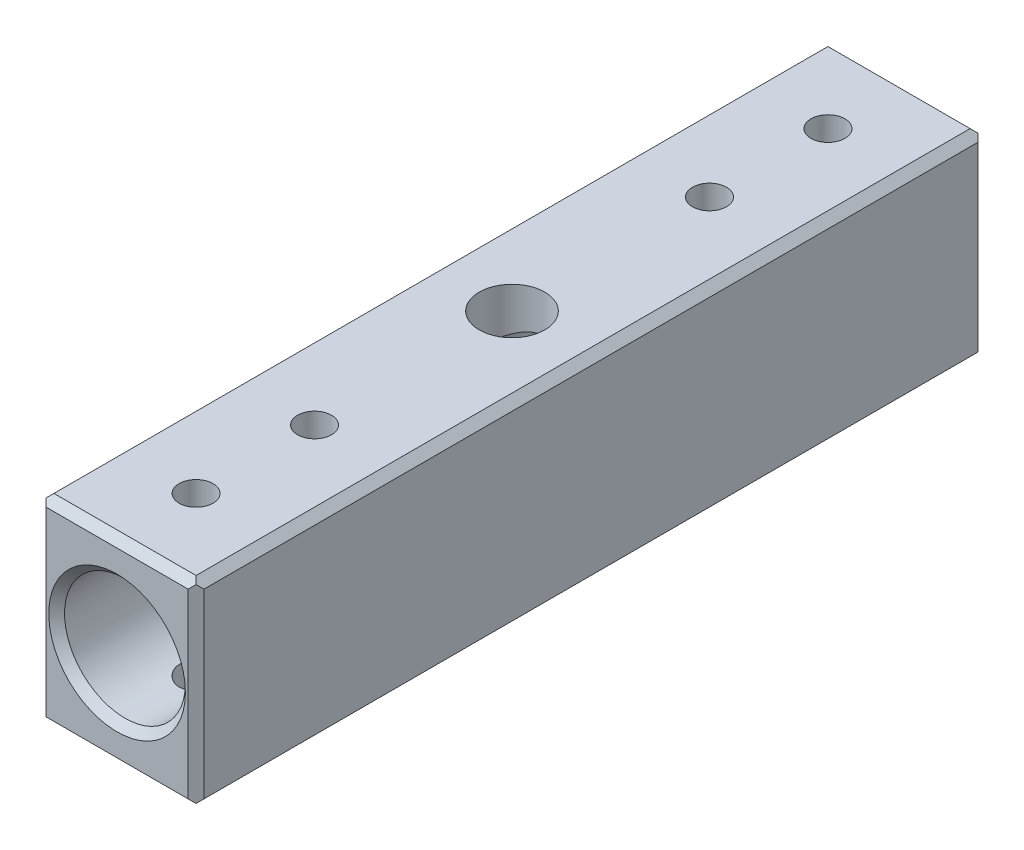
ISO-10303-21;
HEADER;
FILE_DESCRIPTION(('STEP AP214'),'2;1');
FILE_NAME('part.step','',(''),(''),'','','');
FILE_SCHEMA(('AUTOMOTIVE_DESIGN { 1 0 10303 214 1 1 1 1 }'));
ENDSEC;
DATA;
#1=APPLICATION_CONTEXT('core data for automotive mechanical design processes');
#2=APPLICATION_PROTOCOL_DEFINITION('international standard','automotive_design',2000,#1);
#3=PRODUCT_CONTEXT('',#1,'mechanical');
#4=PRODUCT('Part','Part','',(#3));
#5=PRODUCT_RELATED_PRODUCT_CATEGORY('part','',(#4));
#6=PRODUCT_DEFINITION_FORMATION('','',#4);
#7=PRODUCT_DEFINITION_CONTEXT('part definition',#1,'design');
#8=PRODUCT_DEFINITION('design','',#6,#7);
#9=PRODUCT_DEFINITION_SHAPE('','',#8);
#10=(LENGTH_UNIT() NAMED_UNIT(*) SI_UNIT(.MILLI.,.METRE.));
#11=(NAMED_UNIT(*) PLANE_ANGLE_UNIT() SI_UNIT($,.RADIAN.));
#12=(NAMED_UNIT(*) SI_UNIT($,.STERADIAN.) SOLID_ANGLE_UNIT());
#13=UNCERTAINTY_MEASURE_WITH_UNIT(LENGTH_MEASURE(1.E-05),#10,'distance_accuracy_value','');
#14=(GEOMETRIC_REPRESENTATION_CONTEXT(3) GLOBAL_UNCERTAINTY_ASSIGNED_CONTEXT((#13)) GLOBAL_UNIT_ASSIGNED_CONTEXT((#10,
#11,#12)) REPRESENTATION_CONTEXT('',''));
#15=CARTESIAN_POINT('',(0.,0.,0.));
#16=DIRECTION('',(0.,0.,1.));
#17=DIRECTION('',(1.,0.,0.));
#18=AXIS2_PLACEMENT_3D('',#15,#16,#17);
#19=CARTESIAN_POINT('',(-10.,-12.5,-100.));
#20=DIRECTION('',(0.,-1.,0.));
#21=DIRECTION('',(0.,0.,-1.));
#22=AXIS2_PLACEMENT_3D('',#19,#20,#21);
#23=PLANE('',#22);
#24=CARTESIAN_POINT('',(0.,-12.5,-25.));
#25=DIRECTION('',(0.,1.,0.));
#26=DIRECTION('',(0.,0.,1.));
#27=AXIS2_PLACEMENT_3D('',#24,#25,#26);
#28=CIRCLE('',#27,2.14999999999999);
#29=CARTESIAN_POINT('',(0.,-12.5,-22.85));
#30=VERTEX_POINT('',#29);
#31=EDGE_CURVE('E550',#30,#30,#28,.F.);
#32=ORIENTED_EDGE('',*,*,#31,.F.);
#33=EDGE_LOOP('',(#32));
#34=FACE_BOUND('',#33,.T.);
#35=CARTESIAN_POINT('',(0.,-12.5,-90.));
#36=DIRECTION('',(0.,1.,0.));
#37=DIRECTION('',(0.,0.,1.));
#38=AXIS2_PLACEMENT_3D('',#35,#36,#37);
#39=CIRCLE('',#38,2.15);
#40=CARTESIAN_POINT('',(0.,-12.5,-87.85));
#41=VERTEX_POINT('',#40);
#42=EDGE_CURVE('E556',#41,#41,#39,.T.);
#43=ORIENTED_EDGE('',*,*,#42,.T.);
#44=EDGE_LOOP('',(#43));
#45=FACE_BOUND('',#44,.T.);
#46=CARTESIAN_POINT('',(0.,-12.5,-75.));
#47=DIRECTION('',(0.,1.,0.));
#48=DIRECTION('',(0.,0.,1.));
#49=AXIS2_PLACEMENT_3D('',#46,#47,#48);
#50=CIRCLE('',#49,2.15);
#51=CARTESIAN_POINT('',(0.,-12.5,-72.85));
#52=VERTEX_POINT('',#51);
#53=EDGE_CURVE('E520',#52,#52,#50,.T.);
#54=ORIENTED_EDGE('',*,*,#53,.T.);
#55=EDGE_LOOP('',(#54));
#56=FACE_BOUND('',#55,.T.);
#57=CARTESIAN_POINT('',(0.,-12.5,-50.));
#58=DIRECTION('',(0.,1.,0.));
#59=DIRECTION('',(0.,0.,1.));
#60=AXIS2_PLACEMENT_3D('',#57,#58,#59);
#61=CIRCLE('',#60,4.15);
#62=CARTESIAN_POINT('',(0.,-12.5,-45.85));
#63=VERTEX_POINT('',#62);
#64=EDGE_CURVE('E532',#63,#63,#61,.T.);
#65=ORIENTED_EDGE('',*,*,#64,.T.);
#66=EDGE_LOOP('',(#65));
#67=FACE_BOUND('',#66,.T.);
#68=DIRECTION('',(1.,0.,0.));
#69=VECTOR('',#68,1.);
#70=CARTESIAN_POINT('',(10.,-12.5,-99.));
#71=LINE('',#70,#69);
#72=CARTESIAN_POINT('',(-9.00000000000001,-12.5,-99.));
#73=VERTEX_POINT('',#72);
#74=CARTESIAN_POINT('',(9.00000000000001,-12.5,-99.));
#75=VERTEX_POINT('',#74);
#76=EDGE_CURVE('E190',#73,#75,#71,.T.);
#77=ORIENTED_EDGE('',*,*,#76,.T.);
#78=DIRECTION('',(0.,0.,1.));
#79=VECTOR('',#78,1.);
#80=CARTESIAN_POINT('',(9.00000000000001,-12.5,-100.));
#81=LINE('',#80,#79);
#82=CARTESIAN_POINT('',(9.00000000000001,-12.5,-0.999999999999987));
#83=VERTEX_POINT('',#82);
#84=EDGE_CURVE('E235',#75,#83,#81,.T.);
#85=ORIENTED_EDGE('',*,*,#84,.T.);
#86=DIRECTION('',(-1.,0.,0.));
#87=VECTOR('',#86,1.);
#88=CARTESIAN_POINT('',(-10.,-12.5,-0.999999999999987));
#89=LINE('',#88,#87);
#90=CARTESIAN_POINT('',(-9.00000000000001,-12.5,-0.999999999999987));
#91=VERTEX_POINT('',#90);
#92=EDGE_CURVE('E187',#83,#91,#89,.T.);
#93=ORIENTED_EDGE('',*,*,#92,.T.);
#94=DIRECTION('',(0.,0.,-1.));
#95=VECTOR('',#94,1.);
#96=CARTESIAN_POINT('',(-9.00000000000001,-12.5,-100.));
#97=LINE('',#96,#95);
#98=EDGE_CURVE('E218',#91,#73,#97,.T.);
#99=ORIENTED_EDGE('',*,*,#98,.T.);
#100=EDGE_LOOP('',(#77,#85,#93,#99));
#101=FACE_BOUND('',#100,.T.);
#102=CARTESIAN_POINT('',(0.,-12.5,-9.99999999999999));
#103=DIRECTION('',(0.,1.,0.));
#104=DIRECTION('',(0.,0.,1.));
#105=AXIS2_PLACEMENT_3D('',#102,#103,#104);
#106=CIRCLE('',#105,2.15);
#107=CARTESIAN_POINT('',(0.,-12.5,-7.85));
#108=VERTEX_POINT('',#107);
#109=EDGE_CURVE('E544',#108,#108,#106,.F.);
#110=ORIENTED_EDGE('',*,*,#109,.F.);
#111=EDGE_LOOP('',(#110));
#112=FACE_BOUND('',#111,.T.);
#113=ADVANCED_FACE('F37',(#34,#45,#56,#67,#101,#112),#23,.T.);
#114=CARTESIAN_POINT('',(-10.,12.5,-100.));
#115=DIRECTION('',(0.,1.,0.));
#116=DIRECTION('',(0.,0.,1.));
#117=AXIS2_PLACEMENT_3D('',#114,#115,#116);
#118=PLANE('',#117);
#119=CARTESIAN_POINT('',(0.,12.5,-25.));
#120=DIRECTION('',(0.,1.,0.));
#121=DIRECTION('',(0.,0.,1.));
#122=AXIS2_PLACEMENT_3D('',#119,#120,#121);
#123=CIRCLE('',#122,2.14999999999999);
#124=CARTESIAN_POINT('',(0.,12.5,-22.85));
#125=VERTEX_POINT('',#124);
#126=EDGE_CURVE('E547',#125,#125,#123,.F.);
#127=ORIENTED_EDGE('',*,*,#126,.T.);
#128=EDGE_LOOP('',(#127));
#129=FACE_BOUND('',#128,.T.);
#130=CARTESIAN_POINT('',(0.,12.5,-90.));
#131=DIRECTION('',(0.,1.,0.));
#132=DIRECTION('',(0.,0.,1.));
#133=AXIS2_PLACEMENT_3D('',#130,#131,#132);
#134=CIRCLE('',#133,2.15);
#135=CARTESIAN_POINT('',(0.,12.5,-87.85));
#136=VERTEX_POINT('',#135);
#137=EDGE_CURVE('E553',#136,#136,#134,.T.);
#138=ORIENTED_EDGE('',*,*,#137,.F.);
#139=EDGE_LOOP('',(#138));
#140=FACE_BOUND('',#139,.T.);
#141=CARTESIAN_POINT('',(0.,12.5,-75.));
#142=DIRECTION('',(0.,1.,0.));
#143=DIRECTION('',(0.,0.,1.));
#144=AXIS2_PLACEMENT_3D('',#141,#142,#143);
#145=CIRCLE('',#144,2.15);
#146=CARTESIAN_POINT('',(0.,12.5,-72.85));
#147=VERTEX_POINT('',#146);
#148=EDGE_CURVE('E559',#147,#147,#145,.T.);
#149=ORIENTED_EDGE('',*,*,#148,.F.);
#150=EDGE_LOOP('',(#149));
#151=FACE_BOUND('',#150,.T.);
#152=CARTESIAN_POINT('',(0.,12.5,-50.));
#153=DIRECTION('',(0.,1.,0.));
#154=DIRECTION('',(0.,0.,1.));
#155=AXIS2_PLACEMENT_3D('',#152,#153,#154);
#156=CIRCLE('',#155,4.15);
#157=CARTESIAN_POINT('',(0.,12.5,-45.85));
#158=VERTEX_POINT('',#157);
#159=EDGE_CURVE('E536',#158,#158,#156,.T.);
#160=ORIENTED_EDGE('',*,*,#159,.F.);
#161=EDGE_LOOP('',(#160));
#162=FACE_BOUND('',#161,.T.);
#163=DIRECTION('',(1.,0.,0.));
#164=VECTOR('',#163,1.);
#165=CARTESIAN_POINT('',(-10.,12.5,-0.999999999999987));
#166=LINE('',#165,#164);
#167=CARTESIAN_POINT('',(-9.00000000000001,12.5,-0.999999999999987));
#168=VERTEX_POINT('',#167);
#169=CARTESIAN_POINT('',(9.00000000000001,12.5,-0.999999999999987));
#170=VERTEX_POINT('',#169);
#171=EDGE_CURVE('E283',#168,#170,#166,.T.);
#172=ORIENTED_EDGE('',*,*,#171,.T.);
#173=DIRECTION('',(0.,0.,-1.));
#174=VECTOR('',#173,1.);
#175=CARTESIAN_POINT('',(9.00000000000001,12.5,-100.));
#176=LINE('',#175,#174);
#177=CARTESIAN_POINT('',(9.00000000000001,12.5,-99.));
#178=VERTEX_POINT('',#177);
#179=EDGE_CURVE('E59',#170,#178,#176,.T.);
#180=ORIENTED_EDGE('',*,*,#179,.T.);
#181=DIRECTION('',(-1.,0.,0.));
#182=VECTOR('',#181,1.);
#183=CARTESIAN_POINT('',(-10.,12.5,-99.));
#184=LINE('',#183,#182);
#185=CARTESIAN_POINT('',(-9.00000000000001,12.5,-99.));
#186=VERTEX_POINT('',#185);
#187=EDGE_CURVE('E284',#178,#186,#184,.T.);
#188=ORIENTED_EDGE('',*,*,#187,.T.);
#189=DIRECTION('',(0.,0.,1.));
#190=VECTOR('',#189,1.);
#191=CARTESIAN_POINT('',(-9.00000000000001,12.5,-100.));
#192=LINE('',#191,#190);
#193=EDGE_CURVE('E276',#186,#168,#192,.T.);
#194=ORIENTED_EDGE('',*,*,#193,.T.);
#195=EDGE_LOOP('',(#172,#180,#188,#194));
#196=FACE_BOUND('',#195,.T.);
#197=CARTESIAN_POINT('',(0.,12.5,-9.99999999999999));
#198=DIRECTION('',(0.,1.,0.));
#199=DIRECTION('',(0.,0.,1.));
#200=AXIS2_PLACEMENT_3D('',#197,#198,#199);
#201=CIRCLE('',#200,2.15);
#202=CARTESIAN_POINT('',(0.,12.5,-7.85));
#203=VERTEX_POINT('',#202);
#204=EDGE_CURVE('E224',#203,#203,#201,.F.);
#205=ORIENTED_EDGE('',*,*,#204,.T.);
#206=EDGE_LOOP('',(#205));
#207=FACE_BOUND('',#206,.T.);
#208=ADVANCED_FACE('F281',(#129,#140,#151,#162,#196,#207),#118,.T.);
#209=CARTESIAN_POINT('',(0.,0.,-100.));
#210=DIRECTION('',(0.,0.,1.));
#211=DIRECTION('',(1.,0.,0.));
#212=AXIS2_PLACEMENT_3D('',#209,#210,#211);
#213=CYLINDRICAL_SURFACE('',#212,7.65);
#214=CARTESIAN_POINT('',(0.,0.,-99.));
#215=DIRECTION('',(0.,0.,1.));
#216=DIRECTION('',(1.,0.,0.));
#217=AXIS2_PLACEMENT_3D('',#214,#215,#216);
#218=CIRCLE('',#217,7.65);
#219=CARTESIAN_POINT('',(7.65,0.,-99.));
#220=VERTEX_POINT('',#219);
#221=EDGE_CURVE('E202',#220,#220,#218,.F.);
#222=ORIENTED_EDGE('',*,*,#221,.T.);
#223=EDGE_LOOP('',(#222));
#224=FACE_BOUND('',#223,.T.);
#225=CARTESIAN_POINT('',(0.,0.,-1.));
#226=DIRECTION('',(0.,0.,1.));
#227=DIRECTION('',(1.,0.,0.));
#228=AXIS2_PLACEMENT_3D('',#225,#226,#227);
#229=CIRCLE('',#228,7.65);
#230=CARTESIAN_POINT('',(7.65,0.,-1.));
#231=VERTEX_POINT('',#230);
#232=EDGE_CURVE('E199',#231,#231,#229,.T.);
#233=ORIENTED_EDGE('',*,*,#232,.T.);
#234=EDGE_LOOP('',(#233));
#235=FACE_BOUND('',#234,.T.);
#236=CARTESIAN_POINT('',(0.,-7.65,-87.85));
#237=CARTESIAN_POINT('',(-0.118282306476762,-7.64999848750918,-87.850002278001));
#238=CARTESIAN_POINT('',(-0.236588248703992,-7.64723004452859,-87.8597935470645));
#239=CARTESIAN_POINT('',(-0.469776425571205,-7.63645566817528,-87.8986207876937));
#240=CARTESIAN_POINT('',(-0.584657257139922,-7.62844761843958,-87.9276645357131));
#241=CARTESIAN_POINT('',(-0.807596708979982,-7.60807524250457,-88.0039661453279));
#242=CARTESIAN_POINT('',(-0.915664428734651,-7.59571687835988,-88.0511990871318));
#243=CARTESIAN_POINT('',(-1.1223455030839,-7.56794084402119,-88.1624417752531));
#244=CARTESIAN_POINT('',(-1.22095795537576,-7.55252288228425,-88.2264531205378));
#245=CARTESIAN_POINT('',(-1.40844540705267,-7.51984398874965,-88.3711587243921));
#246=CARTESIAN_POINT('',(-1.49704486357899,-7.50254887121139,-88.4522022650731));
#247=CARTESIAN_POINT('',(-1.65959090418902,-7.46827778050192,-88.6279260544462));
#248=CARTESIAN_POINT('',(-1.73353537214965,-7.45130185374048,-88.7226082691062));
#249=CARTESIAN_POINT('',(-1.86605999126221,-7.41923665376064,-88.9251760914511));
#250=CARTESIAN_POINT('',(-1.92431511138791,-7.40419024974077,-89.0332817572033));
#251=CARTESIAN_POINT('',(-2.02171073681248,-7.37819386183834,-89.2582452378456));
#252=CARTESIAN_POINT('',(-2.06085520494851,-7.36724302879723,-89.3751012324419));
#253=CARTESIAN_POINT('',(-2.11794604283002,-7.35103201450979,-89.6111781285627));
#254=CARTESIAN_POINT('',(-2.13639559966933,-7.34563702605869,-89.7302678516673));
#255=CARTESIAN_POINT('',(-2.15314279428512,-7.34074647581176,-89.9699649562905));
#256=CARTESIAN_POINT('',(-2.15144465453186,-7.34124967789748,-90.0905720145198));
#257=CARTESIAN_POINT('',(-2.12834234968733,-7.34797848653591,-90.3258855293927));
#258=CARTESIAN_POINT('',(-2.10755584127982,-7.35402472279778,-90.4406585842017));
#259=CARTESIAN_POINT('',(-2.04785972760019,-7.3708698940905,-90.6650183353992));
#260=CARTESIAN_POINT('',(-2.00894853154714,-7.38166924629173,-90.7746045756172));
#261=CARTESIAN_POINT('',(-1.91362479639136,-7.40695538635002,-90.9870482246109));
#262=CARTESIAN_POINT('',(-1.85700256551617,-7.42148596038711,-91.0898061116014));
#263=CARTESIAN_POINT('',(-1.72801007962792,-7.45257482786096,-91.2845747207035));
#264=CARTESIAN_POINT('',(-1.65563641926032,-7.46913355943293,-91.3765831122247));
#265=CARTESIAN_POINT('',(-1.49407514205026,-7.5031516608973,-91.5507595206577));
#266=CARTESIAN_POINT('',(-1.40437131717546,-7.52062187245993,-91.632447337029));
#267=CARTESIAN_POINT('',(-1.21232206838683,-7.55395658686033,-91.7797243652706));
#268=CARTESIAN_POINT('',(-1.10997603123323,-7.56982101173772,-91.8453127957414));
#269=CARTESIAN_POINT('',(-0.894750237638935,-7.59827289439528,-91.9587735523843));
#270=CARTESIAN_POINT('',(-0.781817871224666,-7.61084266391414,-92.0065508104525));
#271=CARTESIAN_POINT('',(-0.549088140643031,-7.63116144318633,-92.0822985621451));
#272=CARTESIAN_POINT('',(-0.42929245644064,-7.63891162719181,-92.1102738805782));
#273=CARTESIAN_POINT('',(-0.1903280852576,-7.64853698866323,-92.1448507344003));
#274=CARTESIAN_POINT('',(-0.0712608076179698,-7.65059131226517,-92.1521042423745));
#275=CARTESIAN_POINT('',(0.166391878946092,-7.64911293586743,-92.1468433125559));
#276=CARTESIAN_POINT('',(0.284977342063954,-7.64558088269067,-92.134331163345));
#277=CARTESIAN_POINT('',(0.51591729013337,-7.63344305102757,-92.0904259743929));
#278=CARTESIAN_POINT('',(0.62834801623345,-7.6249370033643,-92.0594038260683));
#279=CARTESIAN_POINT('',(0.846393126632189,-7.6038232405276,-91.9797964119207));
#280=CARTESIAN_POINT('',(0.952006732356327,-7.59121505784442,-91.931209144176));
#281=CARTESIAN_POINT('',(1.1558970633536,-7.56288493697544,-91.8166899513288));
#282=CARTESIAN_POINT('',(1.25397137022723,-7.54710278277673,-91.7504129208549));
#283=CARTESIAN_POINT('',(1.43783245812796,-7.51424483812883,-91.6028231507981));
#284=CARTESIAN_POINT('',(1.52361652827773,-7.49716876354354,-91.5215071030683));
#285=CARTESIAN_POINT('',(1.68326234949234,-7.46297612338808,-91.3430943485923));
#286=CARTESIAN_POINT('',(1.75666218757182,-7.44587530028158,-91.2455804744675));
#287=CARTESIAN_POINT('',(1.88607572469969,-7.41415365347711,-91.0392522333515));
#288=CARTESIAN_POINT('',(1.94209006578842,-7.39953273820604,-90.9304382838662));
#289=CARTESIAN_POINT('',(2.0347289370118,-7.37459703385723,-90.7050772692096));
#290=CARTESIAN_POINT('',(2.07145924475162,-7.36425882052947,-90.5885764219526));
#291=CARTESIAN_POINT('',(2.1246994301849,-7.34907704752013,-90.350706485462));
#292=CARTESIAN_POINT('',(2.14121518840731,-7.34423188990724,-90.2293388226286));
#293=CARTESIAN_POINT('',(2.15319250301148,-7.34072854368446,-89.9899375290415));
#294=CARTESIAN_POINT('',(2.14940066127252,-7.34185094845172,-89.8719439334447));
#295=CARTESIAN_POINT('',(2.12262331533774,-7.34963676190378,-89.6383509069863));
#296=CARTESIAN_POINT('',(2.09963841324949,-7.35629999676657,-89.5227514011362));
#297=CARTESIAN_POINT('',(2.03558165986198,-7.37427892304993,-89.2982846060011));
#298=CARTESIAN_POINT('',(1.99468451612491,-7.38554960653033,-89.1893635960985));
#299=CARTESIAN_POINT('',(1.89609929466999,-7.41147040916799,-88.9798438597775));
#300=CARTESIAN_POINT('',(1.8384083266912,-7.42612110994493,-88.8792465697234));
#301=CARTESIAN_POINT('',(1.70568019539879,-7.45774399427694,-88.6857071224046));
#302=CARTESIAN_POINT('',(1.63014153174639,-7.47477601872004,-88.5931186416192));
#303=CARTESIAN_POINT('',(1.46479457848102,-7.50892747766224,-88.4216894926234));
#304=CARTESIAN_POINT('',(1.37498273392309,-7.52604693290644,-88.3428522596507));
#305=CARTESIAN_POINT('',(1.18097920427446,-7.55894771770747,-88.199248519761));
#306=CARTESIAN_POINT('',(1.07648855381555,-7.57468586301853,-88.1348750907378));
#307=CARTESIAN_POINT('',(0.857726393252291,-7.60256067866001,-88.0247066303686));
#308=CARTESIAN_POINT('',(0.743460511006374,-7.6146994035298,-87.9789009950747));
#309=CARTESIAN_POINT('',(0.524870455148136,-7.63264798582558,-87.9123731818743));
#310=CARTESIAN_POINT('',(0.421386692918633,-7.63910498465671,-87.8890412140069));
#311=CARTESIAN_POINT('',(0.211941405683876,-7.64778140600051,-87.8578545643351));
#312=CARTESIAN_POINT('',(0.105980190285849,-7.65000135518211,-87.8499979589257));
#313=CARTESIAN_POINT('',(0.,-7.65,-87.85));
#314=B_SPLINE_CURVE_WITH_KNOTS('',3,(#236,#237,#238,#239,#240,#241,#242,#243,#244,#245,#246,
#247,#248,#249,#250,#251,#252,#253,#254,#255,#256,#257,#258,#259,#260,#261,#262,#263,#264,#265,
#266,#267,#268,#269,#270,#271,#272,#273,#274,#275,#276,#277,#278,#279,#280,#281,#282,#283,#284,
#285,#286,#287,#288,#289,#290,#291,#292,#293,#294,#295,#296,#297,#298,#299,#300,#301,#302,#303,
#304,#305,#306,#307,#308,#309,#310,#311,#312,#313),.UNSPECIFIED.,.T.,.F.,(4,2,2,2,2,2,2,2,2,2,2,
2,2,2,2,2,2,2,2,2,2,2,2,2,2,2,2,2,2,2,2,2,2,2,2,2,2,2,4),(0.,0.354458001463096,
0.709059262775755,1.06317642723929,1.41732735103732,1.77960923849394,2.14194339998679,
2.51128962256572,2.88055922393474,3.2406412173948,3.60064774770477,3.94940071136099,
4.29818429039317,4.65126448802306,5.00442109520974,5.37043481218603,5.73646629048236,
6.1044244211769,6.4722928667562,6.82845228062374,7.18457045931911,7.53378191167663,
7.88303317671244,8.23967110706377,8.59638758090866,8.96436615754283,9.33233114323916,
9.69825608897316,10.0640745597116,10.4165383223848,10.7689910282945,11.1180800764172,
11.4672292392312,11.827691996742,12.1882446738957,12.5576514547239,12.9268469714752,
13.2444785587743,13.56207066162),.UNSPECIFIED.);
#315=CARTESIAN_POINT('',(0.,-7.65,-87.85));
#316=VERTEX_POINT('',#315);
#317=EDGE_CURVE('E468',#316,#316,#314,.T.);
#318=ORIENTED_EDGE('',*,*,#317,.T.);
#319=EDGE_LOOP('',(#318));
#320=FACE_BOUND('',#319,.T.);
#321=CARTESIAN_POINT('',(0.,7.65,-87.85));
#322=CARTESIAN_POINT('',(0.118282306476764,7.64999848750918,-87.850002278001));
#323=CARTESIAN_POINT('',(0.236588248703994,7.64723004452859,-87.8597935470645));
#324=CARTESIAN_POINT('',(0.469776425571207,7.63645566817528,-87.8986207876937));
#325=CARTESIAN_POINT('',(0.584657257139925,7.62844761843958,-87.9276645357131));
#326=CARTESIAN_POINT('',(0.807596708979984,7.60807524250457,-88.0039661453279));
#327=CARTESIAN_POINT('',(0.915664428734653,7.59571687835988,-88.0511990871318));
#328=CARTESIAN_POINT('',(1.1223455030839,7.56794084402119,-88.1624417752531));
#329=CARTESIAN_POINT('',(1.22095795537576,7.55252288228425,-88.2264531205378));
#330=CARTESIAN_POINT('',(1.40844540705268,7.51984398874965,-88.3711587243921));
#331=CARTESIAN_POINT('',(1.497044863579,7.50254887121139,-88.4522022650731));
#332=CARTESIAN_POINT('',(1.65959090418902,7.46827778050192,-88.6279260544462));
#333=CARTESIAN_POINT('',(1.73353537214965,7.45130185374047,-88.7226082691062));
#334=CARTESIAN_POINT('',(1.86605999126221,7.41923665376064,-88.9251760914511));
#335=CARTESIAN_POINT('',(1.92431511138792,7.40419024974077,-89.0332817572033));
#336=CARTESIAN_POINT('',(2.02171073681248,7.37819386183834,-89.2582452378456));
#337=CARTESIAN_POINT('',(2.06085520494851,7.36724302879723,-89.3751012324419));
#338=CARTESIAN_POINT('',(2.11794604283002,7.35103201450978,-89.6111781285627));
#339=CARTESIAN_POINT('',(2.13639559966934,7.34563702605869,-89.7302678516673));
#340=CARTESIAN_POINT('',(2.15314279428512,7.34074647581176,-89.9699649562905));
#341=CARTESIAN_POINT('',(2.15144465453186,7.34124967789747,-90.0905720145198));
#342=CARTESIAN_POINT('',(2.12834234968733,7.34797848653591,-90.3258855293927));
#343=CARTESIAN_POINT('',(2.10755584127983,7.35402472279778,-90.4406585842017));
#344=CARTESIAN_POINT('',(2.04785972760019,7.3708698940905,-90.6650183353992));
#345=CARTESIAN_POINT('',(2.00894853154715,7.38166924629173,-90.7746045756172));
#346=CARTESIAN_POINT('',(1.91362479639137,7.40695538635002,-90.9870482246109));
#347=CARTESIAN_POINT('',(1.85700256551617,7.42148596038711,-91.0898061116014));
#348=CARTESIAN_POINT('',(1.72801007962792,7.45257482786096,-91.2845747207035));
#349=CARTESIAN_POINT('',(1.65563641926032,7.46913355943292,-91.3765831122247));
#350=CARTESIAN_POINT('',(1.49407514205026,7.5031516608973,-91.5507595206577));
#351=CARTESIAN_POINT('',(1.40437131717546,7.52062187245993,-91.632447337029));
#352=CARTESIAN_POINT('',(1.21232206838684,7.55395658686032,-91.7797243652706));
#353=CARTESIAN_POINT('',(1.10997603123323,7.56982101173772,-91.8453127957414));
#354=CARTESIAN_POINT('',(0.894750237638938,7.59827289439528,-91.9587735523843));
#355=CARTESIAN_POINT('',(0.781817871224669,7.61084266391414,-92.0065508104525));
#356=CARTESIAN_POINT('',(0.549088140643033,7.63116144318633,-92.0822985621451));
#357=CARTESIAN_POINT('',(0.429292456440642,7.63891162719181,-92.1102738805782));
#358=CARTESIAN_POINT('',(0.190328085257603,7.64853698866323,-92.1448507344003));
#359=CARTESIAN_POINT('',(0.0712608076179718,7.65059131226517,-92.1521042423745));
#360=CARTESIAN_POINT('',(-0.16639187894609,7.64911293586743,-92.1468433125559));
#361=CARTESIAN_POINT('',(-0.284977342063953,7.64558088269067,-92.134331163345));
#362=CARTESIAN_POINT('',(-0.515917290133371,7.63344305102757,-92.0904259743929));
#363=CARTESIAN_POINT('',(-0.628348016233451,7.6249370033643,-92.0594038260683));
#364=CARTESIAN_POINT('',(-0.84639312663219,7.6038232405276,-91.9797964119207));
#365=CARTESIAN_POINT('',(-0.952006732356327,7.59121505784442,-91.931209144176));
#366=CARTESIAN_POINT('',(-1.1558970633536,7.56288493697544,-91.8166899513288));
#367=CARTESIAN_POINT('',(-1.25397137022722,7.54710278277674,-91.7504129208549));
#368=CARTESIAN_POINT('',(-1.43783245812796,7.51424483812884,-91.6028231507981));
#369=CARTESIAN_POINT('',(-1.52361652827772,7.49716876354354,-91.5215071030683));
#370=CARTESIAN_POINT('',(-1.68326234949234,7.46297612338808,-91.3430943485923));
#371=CARTESIAN_POINT('',(-1.75666218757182,7.44587530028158,-91.2455804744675));
#372=CARTESIAN_POINT('',(-1.88607572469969,7.41415365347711,-91.0392522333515));
#373=CARTESIAN_POINT('',(-1.94209006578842,7.39953273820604,-90.9304382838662));
#374=CARTESIAN_POINT('',(-2.0347289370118,7.37459703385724,-90.7050772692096));
#375=CARTESIAN_POINT('',(-2.07145924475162,7.36425882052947,-90.5885764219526));
#376=CARTESIAN_POINT('',(-2.1246994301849,7.34907704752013,-90.350706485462));
#377=CARTESIAN_POINT('',(-2.14121518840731,7.34423188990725,-90.2293388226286));
#378=CARTESIAN_POINT('',(-2.15319250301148,7.34072854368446,-89.9899375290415));
#379=CARTESIAN_POINT('',(-2.14940066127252,7.34185094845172,-89.8719439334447));
#380=CARTESIAN_POINT('',(-2.12262331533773,7.34963676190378,-89.6383509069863));
#381=CARTESIAN_POINT('',(-2.09963841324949,7.35629999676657,-89.5227514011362));
#382=CARTESIAN_POINT('',(-2.03558165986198,7.37427892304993,-89.2982846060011));
#383=CARTESIAN_POINT('',(-1.9946845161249,7.38554960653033,-89.1893635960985));
#384=CARTESIAN_POINT('',(-1.89609929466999,7.41147040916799,-88.9798438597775));
#385=CARTESIAN_POINT('',(-1.8384083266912,7.42612110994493,-88.8792465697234));
#386=CARTESIAN_POINT('',(-1.70568019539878,7.45774399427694,-88.6857071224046));
#387=CARTESIAN_POINT('',(-1.63014153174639,7.47477601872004,-88.5931186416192));
#388=CARTESIAN_POINT('',(-1.46479457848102,7.50892747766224,-88.4216894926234));
#389=CARTESIAN_POINT('',(-1.37498273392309,7.52604693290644,-88.3428522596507));
#390=CARTESIAN_POINT('',(-1.18097920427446,7.55894771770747,-88.199248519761));
#391=CARTESIAN_POINT('',(-1.07648855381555,7.57468586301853,-88.1348750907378));
#392=CARTESIAN_POINT('',(-0.857726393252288,7.60256067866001,-88.0247066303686));
#393=CARTESIAN_POINT('',(-0.743460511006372,7.6146994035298,-87.9789009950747));
#394=CARTESIAN_POINT('',(-0.524870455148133,7.63264798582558,-87.9123731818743));
#395=CARTESIAN_POINT('',(-0.42138669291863,7.63910498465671,-87.8890412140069));
#396=CARTESIAN_POINT('',(-0.211941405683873,7.64778140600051,-87.8578545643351));
#397=CARTESIAN_POINT('',(-0.105980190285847,7.65000135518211,-87.8499979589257));
#398=CARTESIAN_POINT('',(0.,7.65,-87.85));
#399=B_SPLINE_CURVE_WITH_KNOTS('',3,(#321,#322,#323,#324,#325,#326,#327,#328,#329,#330,#331,
#332,#333,#334,#335,#336,#337,#338,#339,#340,#341,#342,#343,#344,#345,#346,#347,#348,#349,#350,
#351,#352,#353,#354,#355,#356,#357,#358,#359,#360,#361,#362,#363,#364,#365,#366,#367,#368,#369,
#370,#371,#372,#373,#374,#375,#376,#377,#378,#379,#380,#381,#382,#383,#384,#385,#386,#387,#388,
#389,#390,#391,#392,#393,#394,#395,#396,#397,#398),.UNSPECIFIED.,.T.,.F.,(4,2,2,2,2,2,2,2,2,2,2,
2,2,2,2,2,2,2,2,2,2,2,2,2,2,2,2,2,2,2,2,2,2,2,2,2,2,2,4),(0.,0.354458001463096,
0.709059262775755,1.06317642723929,1.41732735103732,1.77960923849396,2.14194339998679,
2.51128962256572,2.88055922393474,3.2406412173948,3.60064774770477,3.94940071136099,
4.29818429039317,4.65126448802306,5.00442109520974,5.37043481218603,5.73646629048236,
6.1044244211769,6.4722928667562,6.82845228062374,7.18457045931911,7.53378191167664,
7.88303317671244,8.23967110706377,8.59638758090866,8.96436615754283,9.33233114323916,
9.69825608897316,10.0640745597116,10.4165383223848,10.7689910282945,11.1180800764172,
11.4672292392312,11.827691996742,12.1882446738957,12.5576514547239,12.9268469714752,
13.2444785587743,13.56207066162),.UNSPECIFIED.);
#400=CARTESIAN_POINT('',(0.,7.65,-87.85));
#401=VERTEX_POINT('',#400);
#402=EDGE_CURVE('E461',#401,#401,#399,.T.);
#403=ORIENTED_EDGE('',*,*,#402,.T.);
#404=EDGE_LOOP('',(#403));
#405=FACE_BOUND('',#404,.T.);
#406=CARTESIAN_POINT('',(0.,-7.65,-72.85));
#407=CARTESIAN_POINT('',(-0.11828230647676,-7.64999848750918,-72.850002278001));
#408=CARTESIAN_POINT('',(-0.236588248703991,-7.64723004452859,-72.8597935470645));
#409=CARTESIAN_POINT('',(-0.469776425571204,-7.63645566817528,-72.8986207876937));
#410=CARTESIAN_POINT('',(-0.58465725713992,-7.62844761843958,-72.9276645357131));
#411=CARTESIAN_POINT('',(-0.807596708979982,-7.60807524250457,-73.0039661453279));
#412=CARTESIAN_POINT('',(-0.915664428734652,-7.59571687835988,-73.0511990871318));
#413=CARTESIAN_POINT('',(-1.1223455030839,-7.56794084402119,-73.1624417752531));
#414=CARTESIAN_POINT('',(-1.22095795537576,-7.55252288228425,-73.2264531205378));
#415=CARTESIAN_POINT('',(-1.40844540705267,-7.51984398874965,-73.3711587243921));
#416=CARTESIAN_POINT('',(-1.49704486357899,-7.50254887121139,-73.4522022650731));
#417=CARTESIAN_POINT('',(-1.65959090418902,-7.46827778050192,-73.6279260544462));
#418=CARTESIAN_POINT('',(-1.73353537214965,-7.45130185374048,-73.7226082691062));
#419=CARTESIAN_POINT('',(-1.8660599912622,-7.41923665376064,-73.9251760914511));
#420=CARTESIAN_POINT('',(-1.92431511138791,-7.40419024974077,-74.0332817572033));
#421=CARTESIAN_POINT('',(-2.02171073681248,-7.37819386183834,-74.2582452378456));
#422=CARTESIAN_POINT('',(-2.06085520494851,-7.36724302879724,-74.3751012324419));
#423=CARTESIAN_POINT('',(-2.11794604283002,-7.35103201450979,-74.6111781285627));
#424=CARTESIAN_POINT('',(-2.13639559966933,-7.34563702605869,-74.7302678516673));
#425=CARTESIAN_POINT('',(-2.15314279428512,-7.34074647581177,-74.9699649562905));
#426=CARTESIAN_POINT('',(-2.15144465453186,-7.34124967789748,-75.0905720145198));
#427=CARTESIAN_POINT('',(-2.12834234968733,-7.34797848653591,-75.3258855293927));
#428=CARTESIAN_POINT('',(-2.10755584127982,-7.35402472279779,-75.4406585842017));
#429=CARTESIAN_POINT('',(-2.04785972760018,-7.3708698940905,-75.6650183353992));
#430=CARTESIAN_POINT('',(-2.00894853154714,-7.38166924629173,-75.7746045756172));
#431=CARTESIAN_POINT('',(-1.91362479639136,-7.40695538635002,-75.9870482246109));
#432=CARTESIAN_POINT('',(-1.85700256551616,-7.42148596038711,-76.0898061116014));
#433=CARTESIAN_POINT('',(-1.72801007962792,-7.45257482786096,-76.2845747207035));
#434=CARTESIAN_POINT('',(-1.65563641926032,-7.46913355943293,-76.3765831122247));
#435=CARTESIAN_POINT('',(-1.49407514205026,-7.5031516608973,-76.5507595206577));
#436=CARTESIAN_POINT('',(-1.40437131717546,-7.52062187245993,-76.632447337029));
#437=CARTESIAN_POINT('',(-1.21232206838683,-7.55395658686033,-76.7797243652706));
#438=CARTESIAN_POINT('',(-1.10997603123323,-7.56982101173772,-76.8453127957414));
#439=CARTESIAN_POINT('',(-0.894750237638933,-7.59827289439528,-76.9587735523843));
#440=CARTESIAN_POINT('',(-0.781817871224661,-7.61084266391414,-77.0065508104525));
#441=CARTESIAN_POINT('',(-0.549088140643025,-7.63116144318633,-77.0822985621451));
#442=CARTESIAN_POINT('',(-0.429292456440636,-7.63891162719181,-77.1102738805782));
#443=CARTESIAN_POINT('',(-0.190328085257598,-7.64853698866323,-77.1448507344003));
#444=CARTESIAN_POINT('',(-0.0712608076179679,-7.65059131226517,-77.1521042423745));
#445=CARTESIAN_POINT('',(0.166391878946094,-7.64911293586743,-77.1468433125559));
#446=CARTESIAN_POINT('',(0.284977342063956,-7.64558088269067,-77.134331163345));
#447=CARTESIAN_POINT('',(0.515917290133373,-7.63344305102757,-77.0904259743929));
#448=CARTESIAN_POINT('',(0.628348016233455,-7.6249370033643,-77.0594038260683));
#449=CARTESIAN_POINT('',(0.846393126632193,-7.6038232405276,-76.9797964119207));
#450=CARTESIAN_POINT('',(0.952006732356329,-7.59121505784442,-76.931209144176));
#451=CARTESIAN_POINT('',(1.15589706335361,-7.56288493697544,-76.8166899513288));
#452=CARTESIAN_POINT('',(1.25397137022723,-7.54710278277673,-76.7504129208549));
#453=CARTESIAN_POINT('',(1.43783245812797,-7.51424483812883,-76.6028231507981));
#454=CARTESIAN_POINT('',(1.52361652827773,-7.49716876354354,-76.5215071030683));
#455=CARTESIAN_POINT('',(1.68326234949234,-7.46297612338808,-76.3430943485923));
#456=CARTESIAN_POINT('',(1.75666218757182,-7.44587530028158,-76.2455804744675));
#457=CARTESIAN_POINT('',(1.88607572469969,-7.4141536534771,-76.0392522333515));
#458=CARTESIAN_POINT('',(1.94209006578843,-7.39953273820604,-75.9304382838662));
#459=CARTESIAN_POINT('',(2.03472893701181,-7.37459703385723,-75.7050772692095));
#460=CARTESIAN_POINT('',(2.07145924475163,-7.36425882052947,-75.5885764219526));
#461=CARTESIAN_POINT('',(2.1246994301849,-7.34907704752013,-75.350706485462));
#462=CARTESIAN_POINT('',(2.14121518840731,-7.34423188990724,-75.2293388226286));
#463=CARTESIAN_POINT('',(2.15319250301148,-7.34072854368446,-74.9899375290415));
#464=CARTESIAN_POINT('',(2.14940066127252,-7.34185094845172,-74.8719439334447));
#465=CARTESIAN_POINT('',(2.12262331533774,-7.34963676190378,-74.6383509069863));
#466=CARTESIAN_POINT('',(2.09963841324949,-7.35629999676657,-74.5227514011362));
#467=CARTESIAN_POINT('',(2.03558165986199,-7.37427892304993,-74.2982846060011));
#468=CARTESIAN_POINT('',(1.99468451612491,-7.38554960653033,-74.1893635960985));
#469=CARTESIAN_POINT('',(1.89609929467,-7.41147040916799,-73.9798438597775));
#470=CARTESIAN_POINT('',(1.83840832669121,-7.42612110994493,-73.8792465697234));
#471=CARTESIAN_POINT('',(1.70568019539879,-7.45774399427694,-73.6857071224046));
#472=CARTESIAN_POINT('',(1.63014153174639,-7.47477601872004,-73.5931186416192));
#473=CARTESIAN_POINT('',(1.46479457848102,-7.50892747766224,-73.4216894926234));
#474=CARTESIAN_POINT('',(1.37498273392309,-7.52604693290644,-73.3428522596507));
#475=CARTESIAN_POINT('',(1.18097920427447,-7.55894771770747,-73.199248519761));
#476=CARTESIAN_POINT('',(1.07648855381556,-7.57468586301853,-73.1348750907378));
#477=CARTESIAN_POINT('',(0.8577263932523,-7.60256067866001,-73.0247066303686));
#478=CARTESIAN_POINT('',(0.743460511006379,-7.6146994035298,-72.9789009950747));
#479=CARTESIAN_POINT('',(0.524870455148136,-7.63264798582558,-72.9123731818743));
#480=CARTESIAN_POINT('',(0.421386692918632,-7.63910498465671,-72.8890412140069));
#481=CARTESIAN_POINT('',(0.211941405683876,-7.64778140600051,-72.8578545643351));
#482=CARTESIAN_POINT('',(0.10598019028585,-7.65000135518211,-72.8499979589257));
#483=CARTESIAN_POINT('',(0.,-7.65,-72.85));
#484=B_SPLINE_CURVE_WITH_KNOTS('',3,(#406,#407,#408,#409,#410,#411,#412,#413,#414,#415,#416,
#417,#418,#419,#420,#421,#422,#423,#424,#425,#426,#427,#428,#429,#430,#431,#432,#433,#434,#435,
#436,#437,#438,#439,#440,#441,#442,#443,#444,#445,#446,#447,#448,#449,#450,#451,#452,#453,#454,
#455,#456,#457,#458,#459,#460,#461,#462,#463,#464,#465,#466,#467,#468,#469,#470,#471,#472,#473,
#474,#475,#476,#477,#478,#479,#480,#481,#482,#483),.UNSPECIFIED.,.T.,.F.,(4,2,2,2,2,2,2,2,2,2,2,
2,2,2,2,2,2,2,2,2,2,2,2,2,2,2,2,2,2,2,2,2,2,2,2,2,2,2,4),(0.,0.354458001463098,
0.709059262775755,1.0631764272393,1.41732735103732,1.77960923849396,2.14194339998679,
2.51128962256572,2.88055922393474,3.24064121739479,3.60064774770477,3.949400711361,
4.29818429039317,4.65126448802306,5.00442109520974,5.37043481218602,5.73646629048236,
6.10442442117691,6.4722928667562,6.82845228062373,7.1845704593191,7.53378191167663,
7.88303317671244,8.23967110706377,8.59638758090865,8.96436615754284,9.33233114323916,
9.69825608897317,10.0640745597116,10.4165383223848,10.7689910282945,11.1180800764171,
11.4672292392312,11.827691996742,12.1882446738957,12.5576514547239,12.9268469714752,
13.2444785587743,13.56207066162),.UNSPECIFIED.);
#485=CARTESIAN_POINT('',(0.,-7.65,-72.85));
#486=VERTEX_POINT('',#485);
#487=EDGE_CURVE('E455',#486,#486,#484,.T.);
#488=ORIENTED_EDGE('',*,*,#487,.T.);
#489=EDGE_LOOP('',(#488));
#490=FACE_BOUND('',#489,.T.);
#491=CARTESIAN_POINT('',(0.,7.65,-72.85));
#492=CARTESIAN_POINT('',(0.118282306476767,7.64999848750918,-72.850002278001));
#493=CARTESIAN_POINT('',(0.236588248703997,7.64723004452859,-72.8597935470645));
#494=CARTESIAN_POINT('',(0.46977642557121,7.63645566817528,-72.8986207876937));
#495=CARTESIAN_POINT('',(0.584657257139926,7.62844761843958,-72.9276645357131));
#496=CARTESIAN_POINT('',(0.807596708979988,7.60807524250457,-73.0039661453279));
#497=CARTESIAN_POINT('',(0.915664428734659,7.59571687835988,-73.0511990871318));
#498=CARTESIAN_POINT('',(1.12234550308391,7.56794084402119,-73.1624417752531));
#499=CARTESIAN_POINT('',(1.22095795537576,7.55252288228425,-73.2264531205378));
#500=CARTESIAN_POINT('',(1.40844540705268,7.51984398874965,-73.3711587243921));
#501=CARTESIAN_POINT('',(1.497044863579,7.50254887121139,-73.4522022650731));
#502=CARTESIAN_POINT('',(1.65959090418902,7.46827778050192,-73.6279260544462));
#503=CARTESIAN_POINT('',(1.73353537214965,7.45130185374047,-73.7226082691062));
#504=CARTESIAN_POINT('',(1.86605999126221,7.41923665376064,-73.9251760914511));
#505=CARTESIAN_POINT('',(1.92431511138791,7.40419024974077,-74.0332817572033));
#506=CARTESIAN_POINT('',(2.02171073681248,7.37819386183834,-74.2582452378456));
#507=CARTESIAN_POINT('',(2.06085520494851,7.36724302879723,-74.3751012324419));
#508=CARTESIAN_POINT('',(2.11794604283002,7.35103201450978,-74.6111781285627));
#509=CARTESIAN_POINT('',(2.13639559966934,7.34563702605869,-74.7302678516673));
#510=CARTESIAN_POINT('',(2.15314279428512,7.34074647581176,-74.9699649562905));
#511=CARTESIAN_POINT('',(2.15144465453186,7.34124967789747,-75.0905720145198));
#512=CARTESIAN_POINT('',(2.12834234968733,7.34797848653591,-75.3258855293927));
#513=CARTESIAN_POINT('',(2.10755584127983,7.35402472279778,-75.4406585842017));
#514=CARTESIAN_POINT('',(2.04785972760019,7.3708698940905,-75.6650183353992));
#515=CARTESIAN_POINT('',(2.00894853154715,7.38166924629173,-75.7746045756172));
#516=CARTESIAN_POINT('',(1.91362479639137,7.40695538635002,-75.9870482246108));
#517=CARTESIAN_POINT('',(1.85700256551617,7.42148596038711,-76.0898061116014));
#518=CARTESIAN_POINT('',(1.72801007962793,7.45257482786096,-76.2845747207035));
#519=CARTESIAN_POINT('',(1.65563641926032,7.46913355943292,-76.3765831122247));
#520=CARTESIAN_POINT('',(1.49407514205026,7.5031516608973,-76.5507595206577));
#521=CARTESIAN_POINT('',(1.40437131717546,7.52062187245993,-76.632447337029));
#522=CARTESIAN_POINT('',(1.21232206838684,7.55395658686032,-76.7797243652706));
#523=CARTESIAN_POINT('',(1.10997603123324,7.56982101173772,-76.8453127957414));
#524=CARTESIAN_POINT('',(0.894750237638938,7.59827289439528,-76.9587735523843));
#525=CARTESIAN_POINT('',(0.781817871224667,7.61084266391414,-77.0065508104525));
#526=CARTESIAN_POINT('',(0.549088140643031,7.63116144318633,-77.0822985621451));
#527=CARTESIAN_POINT('',(0.429292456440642,7.63891162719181,-77.1102738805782));
#528=CARTESIAN_POINT('',(0.190328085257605,7.64853698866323,-77.1448507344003));
#529=CARTESIAN_POINT('',(0.071260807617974,7.65059131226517,-77.1521042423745));
#530=CARTESIAN_POINT('',(-0.166391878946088,7.64911293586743,-77.1468433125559));
#531=CARTESIAN_POINT('',(-0.28497734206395,7.64558088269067,-77.134331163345));
#532=CARTESIAN_POINT('',(-0.515917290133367,7.63344305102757,-77.0904259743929));
#533=CARTESIAN_POINT('',(-0.628348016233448,7.6249370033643,-77.0594038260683));
#534=CARTESIAN_POINT('',(-0.846393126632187,7.6038232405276,-76.9797964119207));
#535=CARTESIAN_POINT('',(-0.952006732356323,7.59121505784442,-76.931209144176));
#536=CARTESIAN_POINT('',(-1.1558970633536,7.56288493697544,-76.8166899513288));
#537=CARTESIAN_POINT('',(-1.25397137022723,7.54710278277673,-76.7504129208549));
#538=CARTESIAN_POINT('',(-1.43783245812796,7.51424483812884,-76.6028231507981));
#539=CARTESIAN_POINT('',(-1.52361652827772,7.49716876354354,-76.5215071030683));
#540=CARTESIAN_POINT('',(-1.68326234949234,7.46297612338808,-76.3430943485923));
#541=CARTESIAN_POINT('',(-1.75666218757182,7.44587530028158,-76.2455804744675));
#542=CARTESIAN_POINT('',(-1.88607572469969,7.41415365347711,-76.0392522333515));
#543=CARTESIAN_POINT('',(-1.94209006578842,7.39953273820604,-75.9304382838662));
#544=CARTESIAN_POINT('',(-2.0347289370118,7.37459703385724,-75.7050772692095));
#545=CARTESIAN_POINT('',(-2.07145924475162,7.36425882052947,-75.5885764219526));
#546=CARTESIAN_POINT('',(-2.1246994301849,7.34907704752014,-75.350706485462));
#547=CARTESIAN_POINT('',(-2.14121518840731,7.34423188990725,-75.2293388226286));
#548=CARTESIAN_POINT('',(-2.15319250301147,7.34072854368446,-74.9899375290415));
#549=CARTESIAN_POINT('',(-2.14940066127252,7.34185094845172,-74.8719439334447));
#550=CARTESIAN_POINT('',(-2.12262331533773,7.34963676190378,-74.6383509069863));
#551=CARTESIAN_POINT('',(-2.09963841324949,7.35629999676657,-74.5227514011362));
#552=CARTESIAN_POINT('',(-2.03558165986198,7.37427892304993,-74.2982846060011));
#553=CARTESIAN_POINT('',(-1.9946845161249,7.38554960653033,-74.1893635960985));
#554=CARTESIAN_POINT('',(-1.89609929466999,7.41147040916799,-73.9798438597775));
#555=CARTESIAN_POINT('',(-1.8384083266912,7.42612110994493,-73.8792465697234));
#556=CARTESIAN_POINT('',(-1.70568019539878,7.45774399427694,-73.6857071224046));
#557=CARTESIAN_POINT('',(-1.63014153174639,7.47477601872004,-73.5931186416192));
#558=CARTESIAN_POINT('',(-1.46479457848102,7.50892747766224,-73.4216894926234));
#559=CARTESIAN_POINT('',(-1.37498273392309,7.52604693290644,-73.3428522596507));
#560=CARTESIAN_POINT('',(-1.18097920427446,7.55894771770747,-73.199248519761));
#561=CARTESIAN_POINT('',(-1.07648855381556,7.57468586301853,-73.1348750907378));
#562=CARTESIAN_POINT('',(-0.857726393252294,7.60256067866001,-73.0247066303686));
#563=CARTESIAN_POINT('',(-0.743460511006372,7.6146994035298,-72.9789009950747));
#564=CARTESIAN_POINT('',(-0.52487045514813,7.63264798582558,-72.9123731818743));
#565=CARTESIAN_POINT('',(-0.421386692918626,7.63910498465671,-72.8890412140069));
#566=CARTESIAN_POINT('',(-0.21194140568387,7.64778140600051,-72.8578545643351));
#567=CARTESIAN_POINT('',(-0.105980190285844,7.65000135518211,-72.8499979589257));
#568=CARTESIAN_POINT('',(0.,7.65,-72.85));
#569=B_SPLINE_CURVE_WITH_KNOTS('',3,(#491,#492,#493,#494,#495,#496,#497,#498,#499,#500,#501,
#502,#503,#504,#505,#506,#507,#508,#509,#510,#511,#512,#513,#514,#515,#516,#517,#518,#519,#520,
#521,#522,#523,#524,#525,#526,#527,#528,#529,#530,#531,#532,#533,#534,#535,#536,#537,#538,#539,
#540,#541,#542,#543,#544,#545,#546,#547,#548,#549,#550,#551,#552,#553,#554,#555,#556,#557,#558,
#559,#560,#561,#562,#563,#564,#565,#566,#567,#568),.UNSPECIFIED.,.T.,.F.,(4,2,2,2,2,2,2,2,2,2,2,
2,2,2,2,2,2,2,2,2,2,2,2,2,2,2,2,2,2,2,2,2,2,2,2,2,2,2,4),(0.,0.354458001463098,
0.709059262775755,1.0631764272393,1.41732735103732,1.77960923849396,2.14194339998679,
2.5112896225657,2.88055922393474,3.24064121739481,3.60064774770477,3.949400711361,
4.29818429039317,4.65126448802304,5.00442109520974,5.37043481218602,5.73646629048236,
6.10442442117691,6.4722928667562,6.82845228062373,7.1845704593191,7.53378191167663,
7.88303317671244,8.23967110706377,8.59638758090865,8.96436615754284,9.33233114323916,
9.69825608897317,10.0640745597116,10.4165383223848,10.7689910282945,11.1180800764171,
11.4672292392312,11.827691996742,12.1882446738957,12.5576514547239,12.9268469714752,
13.2444785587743,13.56207066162),.UNSPECIFIED.);
#570=CARTESIAN_POINT('',(0.,7.65,-72.85));
#571=VERTEX_POINT('',#570);
#572=EDGE_CURVE('E448',#571,#571,#569,.T.);
#573=ORIENTED_EDGE('',*,*,#572,.T.);
#574=EDGE_LOOP('',(#573));
#575=FACE_BOUND('',#574,.T.);
#576=CARTESIAN_POINT('',(0.,-7.65,-45.85));
#577=CARTESIAN_POINT('',(-0.107989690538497,-7.65000066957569,-45.8499992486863));
#578=CARTESIAN_POINT('',(-0.215969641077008,-7.6477086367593,-45.8542193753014));
#579=CARTESIAN_POINT('',(-0.43111816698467,-7.63860149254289,-45.8710433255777));
#580=CARTESIAN_POINT('',(-0.538286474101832,-7.63178494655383,-45.8836498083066));
#581=CARTESIAN_POINT('',(-0.751071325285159,-7.61379003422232,-45.9171089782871));
#582=CARTESIAN_POINT('',(-0.856686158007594,-7.60260718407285,-45.9379701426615));
#583=CARTESIAN_POINT('',(-1.06551298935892,-7.57616583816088,-45.9876784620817));
#584=CARTESIAN_POINT('',(-1.16872398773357,-7.56090567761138,-46.0165288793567));
#585=CARTESIAN_POINT('',(-1.47277470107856,-7.5096867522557,-46.1143178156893));
#586=CARTESIAN_POINT('',(-1.66914838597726,-7.46818940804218,-46.1946734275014));
#587=CARTESIAN_POINT('',(-2.04514025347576,-7.37411701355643,-46.3827892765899));
#588=CARTESIAN_POINT('',(-2.22475800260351,-7.32154167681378,-46.4905502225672));
#589=CARTESIAN_POINT('',(-2.57593748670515,-7.20579337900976,-46.7386658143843));
#590=CARTESIAN_POINT('',(-2.74613436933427,-7.14214433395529,-46.8807310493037));
#591=CARTESIAN_POINT('',(-3.06155337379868,-7.01274044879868,-47.1896177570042));
#592=CARTESIAN_POINT('',(-3.20675281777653,-6.94698376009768,-47.3564614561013));
#593=CARTESIAN_POINT('',(-3.48209204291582,-6.81345027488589,-47.7292965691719));
#594=CARTESIAN_POINT('',(-3.60948291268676,-6.74607694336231,-47.9375026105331));
#595=CARTESIAN_POINT('',(-3.77250071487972,-6.65542077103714,-48.2662903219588));
#596=CARTESIAN_POINT('',(-3.8221735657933,-6.62692839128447,-48.3786721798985));
#597=CARTESIAN_POINT('',(-3.91162924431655,-6.57452206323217,-48.6083070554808));
#598=CARTESIAN_POINT('',(-3.95141838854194,-6.55060519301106,-48.7255569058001));
#599=CARTESIAN_POINT('',(-4.01839270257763,-6.50972087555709,-48.9566488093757));
#600=CARTESIAN_POINT('',(-4.04620875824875,-6.49241326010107,-49.0702479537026));
#601=CARTESIAN_POINT('',(-4.09222088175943,-6.46351059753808,-49.300039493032));
#602=CARTESIAN_POINT('',(-4.11042252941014,-6.4519122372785,-49.4162303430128));
#603=CARTESIAN_POINT('',(-4.13689469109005,-6.4349709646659,-49.6500894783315));
#604=CARTESIAN_POINT('',(-4.14517408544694,-6.42962245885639,-49.7677563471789));
#605=CARTESIAN_POINT('',(-4.15167260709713,-6.42542849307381,-50.0034752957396));
#606=CARTESIAN_POINT('',(-4.14989303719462,-6.42658219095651,-50.1215273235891));
#607=CARTESIAN_POINT('',(-4.13731356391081,-6.43468562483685,-50.3394580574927));
#608=CARTESIAN_POINT('',(-4.12788140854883,-6.44075628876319,-50.4394515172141));
#609=CARTESIAN_POINT('',(-4.10186929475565,-6.45735222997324,-50.6381399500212));
#610=CARTESIAN_POINT('',(-4.08528715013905,-6.46787886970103,-50.7368345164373));
#611=CARTESIAN_POINT('',(-4.02509466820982,-6.50564545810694,-51.0299600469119));
#612=CARTESIAN_POINT('',(-3.97103071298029,-6.53907743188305,-51.221558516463));
#613=CARTESIAN_POINT('',(-3.83584781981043,-6.6192905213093,-51.596715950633));
#614=CARTESIAN_POINT('',(-3.75415953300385,-6.66634928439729,-51.7800051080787));
#615=CARTESIAN_POINT('',(-3.56650459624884,-6.76860053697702,-52.1312449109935));
#616=CARTESIAN_POINT('',(-3.46052732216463,-6.82379658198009,-52.299188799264));
#617=CARTESIAN_POINT('',(-3.2085259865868,-6.94624771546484,-52.6419294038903));
#618=CARTESIAN_POINT('',(-3.05885691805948,-7.01405659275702,-52.8138509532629));
#619=CARTESIAN_POINT('',(-2.73271613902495,-7.14742925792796,-53.1315406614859));
#620=CARTESIAN_POINT('',(-2.55622713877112,-7.21299156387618,-53.2772918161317));
#621=CARTESIAN_POINT('',(-2.2679404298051,-7.30685255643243,-53.4776206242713));
#622=CARTESIAN_POINT('',(-2.1644768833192,-7.33824183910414,-53.5429650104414));
#623=CARTESIAN_POINT('',(-1.95147563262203,-7.39773233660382,-53.6645959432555));
#624=CARTESIAN_POINT('',(-1.84194054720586,-7.42583495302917,-53.7208863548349));
#625=CARTESIAN_POINT('',(-1.6175378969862,-7.47792326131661,-53.8237812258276));
#626=CARTESIAN_POINT('',(-1.50267296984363,-7.50191096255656,-53.870390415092));
#627=CARTESIAN_POINT('',(-1.26841964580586,-7.54505038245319,-53.9533584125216));
#628=CARTESIAN_POINT('',(-1.14903187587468,-7.5642027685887,-53.9897186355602));
#629=CARTESIAN_POINT('',(-0.917871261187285,-7.5955477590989,-54.048816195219));
#630=CARTESIAN_POINT('',(-0.806403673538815,-7.60821743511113,-54.0724968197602));
#631=CARTESIAN_POINT('',(-0.581467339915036,-7.62870528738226,-54.1106452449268));
#632=CARTESIAN_POINT('',(-0.467998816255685,-7.63652399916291,-54.1251140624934));
#633=CARTESIAN_POINT('',(-0.2400738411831,-7.64708267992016,-54.1446279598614));
#634=CARTESIAN_POINT('',(-0.125617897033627,-7.64982511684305,-54.1496776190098));
#635=CARTESIAN_POINT('',(0.103322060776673,-7.65015863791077,-54.1502924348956));
#636=CARTESIAN_POINT('',(0.217806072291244,-7.64775003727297,-54.1458581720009));
#637=CARTESIAN_POINT('',(0.434976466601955,-7.6383218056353,-54.1284389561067));
#638=CARTESIAN_POINT('',(0.537751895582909,-7.63176120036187,-54.1163049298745));
#639=CARTESIAN_POINT('',(0.741795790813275,-7.61464026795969,-54.084472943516));
#640=CARTESIAN_POINT('',(0.843063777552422,-7.6040786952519,-54.0647726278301));
#641=CARTESIAN_POINT('',(1.14351519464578,-7.56673278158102,-53.9946298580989));
#642=CARTESIAN_POINT('',(1.33954061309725,-7.53427815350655,-53.9331295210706));
#643=CARTESIAN_POINT('',(1.72264819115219,-7.45615299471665,-53.7813391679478));
#644=CARTESIAN_POINT('',(1.9094095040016,-7.41018825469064,-53.6904031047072));
#645=CARTESIAN_POINT('',(2.26556122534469,-7.30917380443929,-53.483132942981));
#646=CARTESIAN_POINT('',(2.43494504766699,-7.25412067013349,-53.3667892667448));
#647=CARTESIAN_POINT('',(2.77135102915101,-7.13284664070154,-53.0973414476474));
#648=CARTESIAN_POINT('',(2.9360613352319,-7.06606349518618,-52.9416007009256));
#649=CARTESIAN_POINT('',(3.2382284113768,-6.93279882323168,-52.6053035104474));
#650=CARTESIAN_POINT('',(3.37565817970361,-6.86631765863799,-52.4247227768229));
#651=CARTESIAN_POINT('',(3.62921432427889,-6.73595664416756,-52.0274691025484));
#652=CARTESIAN_POINT('',(3.74305537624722,-6.67262031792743,-51.8091242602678));
#653=CARTESIAN_POINT('',(3.88416435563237,-6.59080594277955,-51.4666472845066));
#654=CARTESIAN_POINT('',(3.9262566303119,-6.56573415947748,-51.3500038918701));
#655=CARTESIAN_POINT('',(4.00005632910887,-6.52103636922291,-51.1124263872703));
#656=CARTESIAN_POINT('',(4.03176565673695,-6.50140936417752,-50.9914930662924));
#657=CARTESIAN_POINT('',(4.08168538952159,-6.47017192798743,-50.7583811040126));
#658=CARTESIAN_POINT('',(4.10091043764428,-6.45796649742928,-50.6464983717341));
#659=CARTESIAN_POINT('',(4.1301472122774,-6.439308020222,-50.4210642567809));
#660=CARTESIAN_POINT('',(4.14016032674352,-6.43285410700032,-50.3075131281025));
#661=CARTESIAN_POINT('',(4.15079512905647,-6.42599722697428,-50.0798596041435));
#662=CARTESIAN_POINT('',(4.15142263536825,-6.42559051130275,-49.9657575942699));
#663=CARTESIAN_POINT('',(4.1432902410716,-6.43083738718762,-49.7380358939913));
#664=CARTESIAN_POINT('',(4.13453104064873,-6.43649052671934,-49.6244161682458));
#665=CARTESIAN_POINT('',(4.10952069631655,-6.45248214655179,-49.4133842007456));
#666=CARTESIAN_POINT('',(4.09439011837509,-6.46211688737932,-49.315783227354));
#667=CARTESIAN_POINT('',(4.05733409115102,-6.48544629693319,-49.1223613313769));
#668=CARTESIAN_POINT('',(4.03540644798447,-6.49914227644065,-49.0265409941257));
#669=CARTESIAN_POINT('',(3.95977464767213,-6.54570335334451,-48.7426297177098));
#670=CARTESIAN_POINT('',(3.89620701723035,-6.58405153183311,-48.5579682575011));
#671=CARTESIAN_POINT('',(3.74033325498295,-6.67389987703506,-48.1903535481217));
#672=CARTESIAN_POINT('',(3.64647206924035,-6.72607514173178,-48.008237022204));
#673=CARTESIAN_POINT('',(3.43415224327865,-6.83691712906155,-47.6610864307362));
#674=CARTESIAN_POINT('',(3.31568042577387,-6.89558732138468,-47.4960615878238));
#675=CARTESIAN_POINT('',(3.03664923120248,-7.02340586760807,-47.1617615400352));
#676=CARTESIAN_POINT('',(2.87243397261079,-7.09279644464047,-46.9956213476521));
#677=CARTESIAN_POINT('',(2.51700805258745,-7.22655809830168,-46.6921750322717));
#678=CARTESIAN_POINT('',(2.32577905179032,-7.29092571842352,-46.554888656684));
#679=CARTESIAN_POINT('',(2.01872449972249,-7.37964353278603,-46.3720442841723));
#680=CARTESIAN_POINT('',(1.91124394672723,-7.40827477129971,-46.3142663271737));
#681=CARTESIAN_POINT('',(1.69084207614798,-7.46166054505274,-46.2081019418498));
#682=CARTESIAN_POINT('',(1.5779234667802,-7.48641698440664,-46.1597108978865));
#683=CARTESIAN_POINT('',(1.34765461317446,-7.53127234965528,-46.0729862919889));
#684=CARTESIAN_POINT('',(1.230313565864,-7.55138038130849,-46.0346330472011));
#685=CARTESIAN_POINT('',(0.992005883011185,-7.58636371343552,-45.9684115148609));
#686=CARTESIAN_POINT('',(0.871041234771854,-7.60124182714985,-45.9405375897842));
#687=CARTESIAN_POINT('',(0.625747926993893,-7.62536721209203,-45.8955403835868));
#688=CARTESIAN_POINT('',(0.501402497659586,-7.63457720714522,-45.8784882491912));
#689=CARTESIAN_POINT('',(0.251366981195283,-7.6468932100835,-45.855718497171));
#690=CARTESIAN_POINT('',(0.125676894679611,-7.64999922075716,-45.8500008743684));
#691=CARTESIAN_POINT('',(0.,-7.65,-45.85));
#692=B_SPLINE_CURVE_WITH_KNOTS('',3,(#576,#577,#578,#579,#580,#581,#582,#583,#584,#585,#586,
#587,#588,#589,#590,#591,#592,#593,#594,#595,#596,#597,#598,#599,#600,#601,#602,#603,#604,#605,
#606,#607,#608,#609,#610,#611,#612,#613,#614,#615,#616,#617,#618,#619,#620,#621,#622,#623,#624,
#625,#626,#627,#628,#629,#630,#631,#632,#633,#634,#635,#636,#637,#638,#639,#640,#641,#642,#643,
#644,#645,#646,#647,#648,#649,#650,#651,#652,#653,#654,#655,#656,#657,#658,#659,#660,#661,#662,
#663,#664,#665,#666,#667,#668,#669,#670,#671,#672,#673,#674,#675,#676,#677,#678,#679,#680,#681,
#682,#683,#684,#685,#686,#687,#688,#689,#690,#691),.UNSPECIFIED.,.T.,.F.,(4,2,2,2,2,2,2,2,2,2,2,
2,2,2,2,2,2,2,2,2,2,2,2,2,2,2,2,2,2,2,2,2,2,2,2,2,2,2,2,2,2,2,2,2,2,2,2,2,2,2,2,2,2,2,2,2,2,4),
(0.,0.323845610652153,0.647793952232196,0.972075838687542,1.29649033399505,1.94195768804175,
2.58744173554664,3.27654964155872,3.96627945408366,4.72165996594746,5.09959788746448,
5.47729364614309,5.83145444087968,6.18540946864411,6.53904747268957,6.89263967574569,
7.19413140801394,7.49571539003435,8.09851005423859,8.71457368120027,9.33090729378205,
10.0414326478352,10.752418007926,11.1309853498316,11.5093906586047,11.887610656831,
12.2657784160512,12.6092780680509,12.9527397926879,13.2960344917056,13.6393081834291,
13.9500223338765,14.2608332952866,14.8818762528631,15.517596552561,16.1535569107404,
16.8595134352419,17.566165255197,18.324365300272,18.7034110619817,19.0823872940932,
19.424416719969,19.7663946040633,20.1081604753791,20.4499008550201,20.7472645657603,
21.0447243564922,21.6392835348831,22.2712090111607,22.9034737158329,23.6314055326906,
24.3598339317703,24.7354128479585,25.1108066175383,25.485458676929,25.8599088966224,
26.2367960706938,26.6136830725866),.UNSPECIFIED.);
#693=CARTESIAN_POINT('',(0.,-7.65,-45.85));
#694=VERTEX_POINT('',#693);
#695=EDGE_CURVE('E442',#694,#694,#692,.T.);
#696=ORIENTED_EDGE('',*,*,#695,.T.);
#697=EDGE_LOOP('',(#696));
#698=FACE_BOUND('',#697,.T.);
#699=CARTESIAN_POINT('',(0.,7.65,-45.85));
#700=CARTESIAN_POINT('',(0.107989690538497,7.65000066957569,-45.8499992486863));
#701=CARTESIAN_POINT('',(0.215969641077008,7.6477086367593,-45.8542193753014));
#702=CARTESIAN_POINT('',(0.43111816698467,7.63860149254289,-45.8710433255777));
#703=CARTESIAN_POINT('',(0.538286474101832,7.63178494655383,-45.8836498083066));
#704=CARTESIAN_POINT('',(0.751071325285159,7.61379003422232,-45.9171089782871));
#705=CARTESIAN_POINT('',(0.856686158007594,7.60260718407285,-45.9379701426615));
#706=CARTESIAN_POINT('',(1.06551298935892,7.57616583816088,-45.9876784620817));
#707=CARTESIAN_POINT('',(1.16872398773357,7.56090567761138,-46.0165288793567));
#708=CARTESIAN_POINT('',(1.47277470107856,7.5096867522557,-46.1143178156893));
#709=CARTESIAN_POINT('',(1.66914838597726,7.46818940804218,-46.1946734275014));
#710=CARTESIAN_POINT('',(2.04514025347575,7.37411701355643,-46.3827892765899));
#711=CARTESIAN_POINT('',(2.2247580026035,7.32154167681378,-46.4905502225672));
#712=CARTESIAN_POINT('',(2.57593748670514,7.20579337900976,-46.7386658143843));
#713=CARTESIAN_POINT('',(2.74613436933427,7.14214433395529,-46.8807310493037));
#714=CARTESIAN_POINT('',(3.06155337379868,7.01274044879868,-47.1896177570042));
#715=CARTESIAN_POINT('',(3.20675281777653,6.94698376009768,-47.3564614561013));
#716=CARTESIAN_POINT('',(3.48209204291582,6.81345027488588,-47.7292965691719));
#717=CARTESIAN_POINT('',(3.60948291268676,6.7460769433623,-47.9375026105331));
#718=CARTESIAN_POINT('',(3.77250071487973,6.65542077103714,-48.2662903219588));
#719=CARTESIAN_POINT('',(3.8221735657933,6.62692839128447,-48.3786721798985));
#720=CARTESIAN_POINT('',(3.91162924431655,6.57452206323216,-48.6083070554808));
#721=CARTESIAN_POINT('',(3.95141838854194,6.55060519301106,-48.7255569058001));
#722=CARTESIAN_POINT('',(4.01839270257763,6.50972087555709,-48.9566488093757));
#723=CARTESIAN_POINT('',(4.04620875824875,6.49241326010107,-49.0702479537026));
#724=CARTESIAN_POINT('',(4.09222088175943,6.46351059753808,-49.300039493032));
#725=CARTESIAN_POINT('',(4.11042252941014,6.4519122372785,-49.4162303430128));
#726=CARTESIAN_POINT('',(4.13689469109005,6.4349709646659,-49.6500894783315));
#727=CARTESIAN_POINT('',(4.14517408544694,6.42962245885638,-49.7677563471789));
#728=CARTESIAN_POINT('',(4.15167260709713,6.4254284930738,-50.0034752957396));
#729=CARTESIAN_POINT('',(4.14989303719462,6.42658219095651,-50.1215273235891));
#730=CARTESIAN_POINT('',(4.13731356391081,6.43468562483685,-50.3394580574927));
#731=CARTESIAN_POINT('',(4.12788140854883,6.44075628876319,-50.4394515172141));
#732=CARTESIAN_POINT('',(4.10186929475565,6.45735222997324,-50.6381399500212));
#733=CARTESIAN_POINT('',(4.08528715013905,6.46787886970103,-50.7368345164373));
#734=CARTESIAN_POINT('',(4.02509466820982,6.50564545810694,-51.0299600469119));
#735=CARTESIAN_POINT('',(3.97103071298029,6.53907743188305,-51.221558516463));
#736=CARTESIAN_POINT('',(3.83584781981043,6.6192905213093,-51.596715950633));
#737=CARTESIAN_POINT('',(3.75415953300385,6.66634928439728,-51.7800051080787));
#738=CARTESIAN_POINT('',(3.56650459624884,6.76860053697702,-52.1312449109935));
#739=CARTESIAN_POINT('',(3.46052732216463,6.82379658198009,-52.299188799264));
#740=CARTESIAN_POINT('',(3.2085259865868,6.94624771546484,-52.6419294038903));
#741=CARTESIAN_POINT('',(3.05885691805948,7.01405659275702,-52.8138509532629));
#742=CARTESIAN_POINT('',(2.73271613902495,7.14742925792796,-53.1315406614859));
#743=CARTESIAN_POINT('',(2.55622713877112,7.21299156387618,-53.2772918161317));
#744=CARTESIAN_POINT('',(2.2679404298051,7.30685255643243,-53.4776206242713));
#745=CARTESIAN_POINT('',(2.1644768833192,7.33824183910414,-53.5429650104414));
#746=CARTESIAN_POINT('',(1.95147563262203,7.39773233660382,-53.6645959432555));
#747=CARTESIAN_POINT('',(1.84194054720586,7.42583495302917,-53.7208863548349));
#748=CARTESIAN_POINT('',(1.6175378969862,7.47792326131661,-53.8237812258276));
#749=CARTESIAN_POINT('',(1.50267296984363,7.50191096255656,-53.870390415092));
#750=CARTESIAN_POINT('',(1.26841964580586,7.54505038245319,-53.9533584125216));
#751=CARTESIAN_POINT('',(1.14903187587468,7.5642027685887,-53.9897186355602));
#752=CARTESIAN_POINT('',(0.917871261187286,7.5955477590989,-54.048816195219));
#753=CARTESIAN_POINT('',(0.806403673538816,7.60821743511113,-54.0724968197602));
#754=CARTESIAN_POINT('',(0.581467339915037,7.62870528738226,-54.1106452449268));
#755=CARTESIAN_POINT('',(0.467998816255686,7.63652399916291,-54.1251140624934));
#756=CARTESIAN_POINT('',(0.240073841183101,7.64708267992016,-54.1446279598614));
#757=CARTESIAN_POINT('',(0.125617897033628,7.64982511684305,-54.1496776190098));
#758=CARTESIAN_POINT('',(-0.103322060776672,7.65015863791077,-54.1502924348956));
#759=CARTESIAN_POINT('',(-0.217806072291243,7.64775003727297,-54.1458581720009));
#760=CARTESIAN_POINT('',(-0.434976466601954,7.6383218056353,-54.1284389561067));
#761=CARTESIAN_POINT('',(-0.537751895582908,7.63176120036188,-54.1163049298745));
#762=CARTESIAN_POINT('',(-0.741795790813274,7.61464026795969,-54.084472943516));
#763=CARTESIAN_POINT('',(-0.843063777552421,7.6040786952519,-54.0647726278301));
#764=CARTESIAN_POINT('',(-1.14351519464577,7.56673278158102,-53.9946298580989));
#765=CARTESIAN_POINT('',(-1.33954061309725,7.53427815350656,-53.9331295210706));
#766=CARTESIAN_POINT('',(-1.72264819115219,7.45615299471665,-53.7813391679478));
#767=CARTESIAN_POINT('',(-1.9094095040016,7.41018825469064,-53.6904031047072));
#768=CARTESIAN_POINT('',(-2.26556122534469,7.30917380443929,-53.483132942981));
#769=CARTESIAN_POINT('',(-2.43494504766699,7.2541206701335,-53.3667892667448));
#770=CARTESIAN_POINT('',(-2.77135102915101,7.13284664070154,-53.0973414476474));
#771=CARTESIAN_POINT('',(-2.93606133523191,7.06606349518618,-52.9416007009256));
#772=CARTESIAN_POINT('',(-3.23822841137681,6.93279882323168,-52.6053035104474));
#773=CARTESIAN_POINT('',(-3.37565817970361,6.86631765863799,-52.4247227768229));
#774=CARTESIAN_POINT('',(-3.62921432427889,6.73595664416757,-52.0274691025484));
#775=CARTESIAN_POINT('',(-3.74305537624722,6.67262031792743,-51.8091242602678));
#776=CARTESIAN_POINT('',(-3.88416435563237,6.59080594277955,-51.4666472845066));
#777=CARTESIAN_POINT('',(-3.9262566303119,6.56573415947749,-51.3500038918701));
#778=CARTESIAN_POINT('',(-4.00005632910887,6.52103636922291,-51.1124263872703));
#779=CARTESIAN_POINT('',(-4.03176565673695,6.50140936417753,-50.9914930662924));
#780=CARTESIAN_POINT('',(-4.08168538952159,6.47017192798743,-50.7583811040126));
#781=CARTESIAN_POINT('',(-4.10091043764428,6.45796649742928,-50.6464983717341));
#782=CARTESIAN_POINT('',(-4.1301472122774,6.439308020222,-50.4210642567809));
#783=CARTESIAN_POINT('',(-4.14016032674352,6.43285410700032,-50.3075131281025));
#784=CARTESIAN_POINT('',(-4.15079512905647,6.42599722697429,-50.0798596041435));
#785=CARTESIAN_POINT('',(-4.15142263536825,6.42559051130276,-49.9657575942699));
#786=CARTESIAN_POINT('',(-4.1432902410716,6.43083738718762,-49.7380358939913));
#787=CARTESIAN_POINT('',(-4.13453104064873,6.43649052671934,-49.6244161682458));
#788=CARTESIAN_POINT('',(-4.10952069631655,6.45248214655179,-49.4133842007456));
#789=CARTESIAN_POINT('',(-4.09439011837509,6.46211688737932,-49.315783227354));
#790=CARTESIAN_POINT('',(-4.05733409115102,6.48544629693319,-49.1223613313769));
#791=CARTESIAN_POINT('',(-4.03540644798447,6.49914227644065,-49.0265409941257));
#792=CARTESIAN_POINT('',(-3.95977464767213,6.54570335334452,-48.7426297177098));
#793=CARTESIAN_POINT('',(-3.89620701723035,6.58405153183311,-48.5579682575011));
#794=CARTESIAN_POINT('',(-3.74033325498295,6.67389987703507,-48.1903535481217));
#795=CARTESIAN_POINT('',(-3.64647206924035,6.72607514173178,-48.008237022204));
#796=CARTESIAN_POINT('',(-3.43415224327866,6.83691712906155,-47.6610864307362));
#797=CARTESIAN_POINT('',(-3.31568042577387,6.89558732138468,-47.4960615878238));
#798=CARTESIAN_POINT('',(-3.03664923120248,7.02340586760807,-47.1617615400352));
#799=CARTESIAN_POINT('',(-2.87243397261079,7.09279644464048,-46.9956213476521));
#800=CARTESIAN_POINT('',(-2.51700805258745,7.22655809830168,-46.6921750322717));
#801=CARTESIAN_POINT('',(-2.32577905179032,7.29092571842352,-46.554888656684));
#802=CARTESIAN_POINT('',(-2.01872449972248,7.37964353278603,-46.3720442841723));
#803=CARTESIAN_POINT('',(-1.91124394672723,7.40827477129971,-46.3142663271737));
#804=CARTESIAN_POINT('',(-1.69084207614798,7.46166054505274,-46.2081019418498));
#805=CARTESIAN_POINT('',(-1.57792346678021,7.48641698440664,-46.1597108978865));
#806=CARTESIAN_POINT('',(-1.34765461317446,7.53127234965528,-46.0729862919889));
#807=CARTESIAN_POINT('',(-1.230313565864,7.55138038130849,-46.0346330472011));
#808=CARTESIAN_POINT('',(-0.992005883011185,7.58636371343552,-45.9684115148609));
#809=CARTESIAN_POINT('',(-0.871041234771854,7.60124182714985,-45.9405375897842));
#810=CARTESIAN_POINT('',(-0.625747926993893,7.62536721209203,-45.8955403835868));
#811=CARTESIAN_POINT('',(-0.501402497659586,7.63457720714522,-45.8784882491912));
#812=CARTESIAN_POINT('',(-0.251366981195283,7.6468932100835,-45.855718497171));
#813=CARTESIAN_POINT('',(-0.125676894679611,7.64999922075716,-45.8500008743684));
#814=CARTESIAN_POINT('',(0.,7.65,-45.85));
#815=B_SPLINE_CURVE_WITH_KNOTS('',3,(#699,#700,#701,#702,#703,#704,#705,#706,#707,#708,#709,
#710,#711,#712,#713,#714,#715,#716,#717,#718,#719,#720,#721,#722,#723,#724,#725,#726,#727,#728,
#729,#730,#731,#732,#733,#734,#735,#736,#737,#738,#739,#740,#741,#742,#743,#744,#745,#746,#747,
#748,#749,#750,#751,#752,#753,#754,#755,#756,#757,#758,#759,#760,#761,#762,#763,#764,#765,#766,
#767,#768,#769,#770,#771,#772,#773,#774,#775,#776,#777,#778,#779,#780,#781,#782,#783,#784,#785,
#786,#787,#788,#789,#790,#791,#792,#793,#794,#795,#796,#797,#798,#799,#800,#801,#802,#803,#804,
#805,#806,#807,#808,#809,#810,#811,#812,#813,#814),.UNSPECIFIED.,.T.,.F.,(4,2,2,2,2,2,2,2,2,2,2,
2,2,2,2,2,2,2,2,2,2,2,2,2,2,2,2,2,2,2,2,2,2,2,2,2,2,2,2,2,2,2,2,2,2,2,2,2,2,2,2,2,2,2,2,2,2,4),
(0.,0.323845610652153,0.647793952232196,0.972075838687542,1.29649033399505,1.94195768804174,
2.58744173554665,3.27654964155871,3.96627945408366,4.72165996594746,5.09959788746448,
5.47729364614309,5.83145444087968,6.18540946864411,6.53904747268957,6.89263967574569,
7.19413140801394,7.49571539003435,8.09851005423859,8.71457368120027,9.33090729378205,
10.0414326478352,10.752418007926,11.1309853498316,11.5093906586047,11.887610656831,
12.2657784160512,12.6092780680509,12.9527397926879,13.2960344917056,13.6393081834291,
13.9500223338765,14.2608332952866,14.8818762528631,15.517596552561,16.1535569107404,
16.8595134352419,17.566165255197,18.324365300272,18.7034110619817,19.0823872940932,
19.424416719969,19.7663946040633,20.1081604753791,20.4499008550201,20.7472645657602,
21.0447243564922,21.6392835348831,22.2712090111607,22.9034737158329,23.6314055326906,
24.3598339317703,24.7354128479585,25.1108066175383,25.485458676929,25.8599088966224,
26.2367960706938,26.6136830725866),.UNSPECIFIED.);
#816=CARTESIAN_POINT('',(0.,7.65,-45.85));
#817=VERTEX_POINT('',#816);
#818=EDGE_CURVE('E434',#817,#817,#815,.T.);
#819=ORIENTED_EDGE('',*,*,#818,.T.);
#820=EDGE_LOOP('',(#819));
#821=FACE_BOUND('',#820,.T.);
#822=CARTESIAN_POINT('',(0.,7.65,-22.85));
#823=CARTESIAN_POINT('',(-0.118282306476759,7.64999848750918,-22.850002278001));
#824=CARTESIAN_POINT('',(-0.236588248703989,7.64723004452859,-22.8597935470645));
#825=CARTESIAN_POINT('',(-0.4697764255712,7.63645566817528,-22.8986207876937));
#826=CARTESIAN_POINT('',(-0.584657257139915,7.62844761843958,-22.9276645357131));
#827=CARTESIAN_POINT('',(-0.807596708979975,7.60807524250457,-23.0039661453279));
#828=CARTESIAN_POINT('',(-0.915664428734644,7.59571687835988,-23.0511990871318));
#829=CARTESIAN_POINT('',(-1.12234550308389,7.5679408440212,-23.1624417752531));
#830=CARTESIAN_POINT('',(-1.22095795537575,7.55252288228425,-23.2264531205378));
#831=CARTESIAN_POINT('',(-1.40844540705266,7.51984398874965,-23.3711587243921));
#832=CARTESIAN_POINT('',(-1.49704486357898,7.50254887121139,-23.452202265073));
#833=CARTESIAN_POINT('',(-1.659590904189,7.46827778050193,-23.6279260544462));
#834=CARTESIAN_POINT('',(-1.73353537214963,7.45130185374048,-23.7226082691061));
#835=CARTESIAN_POINT('',(-1.86605999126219,7.41923665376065,-23.9251760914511));
#836=CARTESIAN_POINT('',(-1.9243151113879,7.40419024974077,-24.0332817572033));
#837=CARTESIAN_POINT('',(-2.02171073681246,7.37819386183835,-24.2582452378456));
#838=CARTESIAN_POINT('',(-2.06085520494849,7.36724302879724,-24.3751012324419));
#839=CARTESIAN_POINT('',(-2.11794604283,7.35103201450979,-24.6111781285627));
#840=CARTESIAN_POINT('',(-2.13639559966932,7.3456370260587,-24.7302678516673));
#841=CARTESIAN_POINT('',(-2.1531427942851,7.34074647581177,-24.9699649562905));
#842=CARTESIAN_POINT('',(-2.15144465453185,7.34124967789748,-25.0905720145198));
#843=CARTESIAN_POINT('',(-2.12834234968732,7.34797848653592,-25.3258855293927));
#844=CARTESIAN_POINT('',(-2.10755584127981,7.35402472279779,-25.4406585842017));
#845=CARTESIAN_POINT('',(-2.04785972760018,7.3708698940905,-25.6650183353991));
#846=CARTESIAN_POINT('',(-2.00894853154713,7.38166924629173,-25.7746045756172));
#847=CARTESIAN_POINT('',(-1.91362479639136,7.40695538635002,-25.9870482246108));
#848=CARTESIAN_POINT('',(-1.85700256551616,7.42148596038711,-26.0898061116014));
#849=CARTESIAN_POINT('',(-1.72801007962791,7.45257482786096,-26.2845747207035));
#850=CARTESIAN_POINT('',(-1.65563641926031,7.46913355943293,-26.3765831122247));
#851=CARTESIAN_POINT('',(-1.49407514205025,7.5031516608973,-26.5507595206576));
#852=CARTESIAN_POINT('',(-1.40437131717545,7.52062187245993,-26.632447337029));
#853=CARTESIAN_POINT('',(-1.21232206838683,7.55395658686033,-26.7797243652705));
#854=CARTESIAN_POINT('',(-1.10997603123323,7.56982101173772,-26.8453127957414));
#855=CARTESIAN_POINT('',(-0.894750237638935,7.59827289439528,-26.9587735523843));
#856=CARTESIAN_POINT('',(-0.781817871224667,7.61084266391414,-27.0065508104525));
#857=CARTESIAN_POINT('',(-0.549088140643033,7.63116144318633,-27.0822985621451));
#858=CARTESIAN_POINT('',(-0.429292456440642,7.63891162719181,-27.1102738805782));
#859=CARTESIAN_POINT('',(-0.190328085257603,7.64853698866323,-27.1448507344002));
#860=CARTESIAN_POINT('',(-0.0712608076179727,7.65059131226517,-27.1521042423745));
#861=CARTESIAN_POINT('',(0.166391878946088,7.64911293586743,-27.1468433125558));
#862=CARTESIAN_POINT('',(0.28497734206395,7.64558088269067,-27.1343311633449));
#863=CARTESIAN_POINT('',(0.515917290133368,7.63344305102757,-27.0904259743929));
#864=CARTESIAN_POINT('',(0.628348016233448,7.6249370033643,-27.0594038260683));
#865=CARTESIAN_POINT('',(0.846393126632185,7.6038232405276,-26.9797964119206));
#866=CARTESIAN_POINT('',(0.95200673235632,7.59121505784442,-26.931209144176));
#867=CARTESIAN_POINT('',(1.1558970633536,7.56288493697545,-26.8166899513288));
#868=CARTESIAN_POINT('',(1.25397137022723,7.54710278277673,-26.7504129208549));
#869=CARTESIAN_POINT('',(1.43783245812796,7.51424483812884,-26.6028231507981));
#870=CARTESIAN_POINT('',(1.52361652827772,7.49716876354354,-26.5215071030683));
#871=CARTESIAN_POINT('',(1.68326234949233,7.46297612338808,-26.3430943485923));
#872=CARTESIAN_POINT('',(1.75666218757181,7.44587530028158,-26.2455804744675));
#873=CARTESIAN_POINT('',(1.88607572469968,7.41415365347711,-26.0392522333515));
#874=CARTESIAN_POINT('',(1.94209006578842,7.39953273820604,-25.9304382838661));
#875=CARTESIAN_POINT('',(2.03472893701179,7.37459703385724,-25.7050772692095));
#876=CARTESIAN_POINT('',(2.07145924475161,7.36425882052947,-25.5885764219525));
#877=CARTESIAN_POINT('',(2.12469943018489,7.34907704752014,-25.350706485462));
#878=CARTESIAN_POINT('',(2.1412151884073,7.34423188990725,-25.2293388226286));
#879=CARTESIAN_POINT('',(2.15319250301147,7.34072854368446,-24.9899375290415));
#880=CARTESIAN_POINT('',(2.14940066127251,7.34185094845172,-24.8719439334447));
#881=CARTESIAN_POINT('',(2.12262331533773,7.34963676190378,-24.6383509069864));
#882=CARTESIAN_POINT('',(2.09963841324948,7.35629999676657,-24.5227514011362));
#883=CARTESIAN_POINT('',(2.03558165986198,7.37427892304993,-24.2982846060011));
#884=CARTESIAN_POINT('',(1.9946845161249,7.38554960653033,-24.1893635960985));
#885=CARTESIAN_POINT('',(1.89609929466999,7.41147040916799,-23.9798438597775));
#886=CARTESIAN_POINT('',(1.8384083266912,7.42612110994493,-23.8792465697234));
#887=CARTESIAN_POINT('',(1.70568019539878,7.45774399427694,-23.6857071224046));
#888=CARTESIAN_POINT('',(1.63014153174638,7.47477601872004,-23.5931186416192));
#889=CARTESIAN_POINT('',(1.46479457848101,7.50892747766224,-23.4216894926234));
#890=CARTESIAN_POINT('',(1.37498273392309,7.52604693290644,-23.3428522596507));
#891=CARTESIAN_POINT('',(1.18097920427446,7.55894771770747,-23.199248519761));
#892=CARTESIAN_POINT('',(1.07648855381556,7.57468586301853,-23.1348750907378));
#893=CARTESIAN_POINT('',(0.857726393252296,7.60256067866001,-23.0247066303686));
#894=CARTESIAN_POINT('',(0.743460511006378,7.6146994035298,-22.9789009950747));
#895=CARTESIAN_POINT('',(0.524870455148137,7.63264798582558,-22.9123731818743));
#896=CARTESIAN_POINT('',(0.421386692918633,7.63910498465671,-22.8890412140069));
#897=CARTESIAN_POINT('',(0.211941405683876,7.64778140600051,-22.8578545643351));
#898=CARTESIAN_POINT('',(0.10598019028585,7.65000135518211,-22.8499979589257));
#899=CARTESIAN_POINT('',(0.,7.65,-22.85));
#900=B_SPLINE_CURVE_WITH_KNOTS('',3,(#822,#823,#824,#825,#826,#827,#828,#829,#830,#831,#832,
#833,#834,#835,#836,#837,#838,#839,#840,#841,#842,#843,#844,#845,#846,#847,#848,#849,#850,#851,
#852,#853,#854,#855,#856,#857,#858,#859,#860,#861,#862,#863,#864,#865,#866,#867,#868,#869,#870,
#871,#872,#873,#874,#875,#876,#877,#878,#879,#880,#881,#882,#883,#884,#885,#886,#887,#888,#889,
#890,#891,#892,#893,#894,#895,#896,#897,#898,#899),.UNSPECIFIED.,.T.,.F.,(4,2,2,2,2,2,2,2,2,2,2,
2,2,2,2,2,2,2,2,2,2,2,2,2,2,2,2,2,2,2,2,2,2,2,2,2,2,2,4),(0.,0.354458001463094,
0.709059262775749,1.06317642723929,1.41732735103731,1.77960923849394,2.14194339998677,
2.51128962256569,2.88055922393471,3.24064121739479,3.60064774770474,3.94940071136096,
4.29818429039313,4.65126448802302,5.00442109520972,5.37043481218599,5.73646629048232,
6.10442442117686,6.47229286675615,6.82845228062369,7.18457045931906,7.53378191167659,
7.88303317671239,8.23967110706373,8.5963875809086,8.96436615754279,9.33233114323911,
9.69825608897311,10.0640745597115,10.4165383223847,10.7689910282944,11.1180800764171,
11.4672292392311,11.827691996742,12.1882446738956,12.5576514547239,12.9268469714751,
13.2444785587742,13.56207066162),.UNSPECIFIED.);
#901=CARTESIAN_POINT('',(0.,7.65,-22.85));
#902=VERTEX_POINT('',#901);
#903=EDGE_CURVE('E474',#902,#902,#900,.T.);
#904=ORIENTED_EDGE('',*,*,#903,.F.);
#905=EDGE_LOOP('',(#904));
#906=FACE_BOUND('',#905,.T.);
#907=CARTESIAN_POINT('',(0.,-7.65,-22.85));
#908=CARTESIAN_POINT('',(0.118282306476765,-7.64999848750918,-22.850002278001));
#909=CARTESIAN_POINT('',(0.236588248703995,-7.64723004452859,-22.8597935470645));
#910=CARTESIAN_POINT('',(0.469776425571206,-7.63645566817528,-22.8986207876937));
#911=CARTESIAN_POINT('',(0.584657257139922,-7.62844761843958,-22.9276645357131));
#912=CARTESIAN_POINT('',(0.807596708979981,-7.60807524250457,-23.0039661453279));
#913=CARTESIAN_POINT('',(0.91566442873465,-7.59571687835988,-23.0511990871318));
#914=CARTESIAN_POINT('',(1.1223455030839,-7.56794084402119,-23.1624417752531));
#915=CARTESIAN_POINT('',(1.22095795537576,-7.55252288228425,-23.2264531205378));
#916=CARTESIAN_POINT('',(1.40844540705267,-7.51984398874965,-23.3711587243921));
#917=CARTESIAN_POINT('',(1.49704486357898,-7.50254887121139,-23.452202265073));
#918=CARTESIAN_POINT('',(1.65959090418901,-7.46827778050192,-23.6279260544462));
#919=CARTESIAN_POINT('',(1.73353537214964,-7.45130185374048,-23.7226082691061));
#920=CARTESIAN_POINT('',(1.8660599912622,-7.41923665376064,-23.9251760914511));
#921=CARTESIAN_POINT('',(1.92431511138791,-7.40419024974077,-24.0332817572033));
#922=CARTESIAN_POINT('',(2.02171073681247,-7.37819386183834,-24.2582452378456));
#923=CARTESIAN_POINT('',(2.0608552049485,-7.36724302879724,-24.3751012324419));
#924=CARTESIAN_POINT('',(2.11794604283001,-7.35103201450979,-24.6111781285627));
#925=CARTESIAN_POINT('',(2.13639559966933,-7.34563702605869,-24.7302678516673));
#926=CARTESIAN_POINT('',(2.15314279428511,-7.34074647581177,-24.9699649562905));
#927=CARTESIAN_POINT('',(2.15144465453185,-7.34124967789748,-25.0905720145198));
#928=CARTESIAN_POINT('',(2.12834234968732,-7.34797848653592,-25.3258855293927));
#929=CARTESIAN_POINT('',(2.10755584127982,-7.35402472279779,-25.4406585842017));
#930=CARTESIAN_POINT('',(2.04785972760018,-7.3708698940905,-25.6650183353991));
#931=CARTESIAN_POINT('',(2.00894853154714,-7.38166924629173,-25.7746045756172));
#932=CARTESIAN_POINT('',(1.91362479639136,-7.40695538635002,-25.9870482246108));
#933=CARTESIAN_POINT('',(1.85700256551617,-7.42148596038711,-26.0898061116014));
#934=CARTESIAN_POINT('',(1.72801007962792,-7.45257482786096,-26.2845747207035));
#935=CARTESIAN_POINT('',(1.65563641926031,-7.46913355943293,-26.3765831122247));
#936=CARTESIAN_POINT('',(1.49407514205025,-7.5031516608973,-26.5507595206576));
#937=CARTESIAN_POINT('',(1.40437131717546,-7.52062187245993,-26.632447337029));
#938=CARTESIAN_POINT('',(1.21232206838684,-7.55395658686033,-26.7797243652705));
#939=CARTESIAN_POINT('',(1.10997603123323,-7.56982101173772,-26.8453127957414));
#940=CARTESIAN_POINT('',(0.894750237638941,-7.59827289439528,-26.9587735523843));
#941=CARTESIAN_POINT('',(0.781817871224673,-7.61084266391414,-27.0065508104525));
#942=CARTESIAN_POINT('',(0.54908814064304,-7.63116144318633,-27.0822985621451));
#943=CARTESIAN_POINT('',(0.429292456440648,-7.63891162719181,-27.1102738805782));
#944=CARTESIAN_POINT('',(0.190328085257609,-7.64853698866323,-27.1448507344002));
#945=CARTESIAN_POINT('',(0.0712608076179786,-7.65059131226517,-27.1521042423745));
#946=CARTESIAN_POINT('',(-0.166391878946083,-7.64911293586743,-27.1468433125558));
#947=CARTESIAN_POINT('',(-0.284977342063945,-7.64558088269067,-27.1343311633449));
#948=CARTESIAN_POINT('',(-0.515917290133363,-7.63344305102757,-27.0904259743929));
#949=CARTESIAN_POINT('',(-0.628348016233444,-7.6249370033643,-27.0594038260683));
#950=CARTESIAN_POINT('',(-0.846393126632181,-7.6038232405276,-26.9797964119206));
#951=CARTESIAN_POINT('',(-0.952006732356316,-7.59121505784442,-26.931209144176));
#952=CARTESIAN_POINT('',(-1.15589706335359,-7.56288493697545,-26.8166899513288));
#953=CARTESIAN_POINT('',(-1.25397137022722,-7.54710278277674,-26.7504129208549));
#954=CARTESIAN_POINT('',(-1.43783245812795,-7.51424483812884,-26.6028231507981));
#955=CARTESIAN_POINT('',(-1.52361652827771,-7.49716876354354,-26.5215071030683));
#956=CARTESIAN_POINT('',(-1.68326234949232,-7.46297612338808,-26.3430943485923));
#957=CARTESIAN_POINT('',(-1.75666218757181,-7.44587530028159,-26.2455804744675));
#958=CARTESIAN_POINT('',(-1.88607572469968,-7.41415365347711,-26.0392522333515));
#959=CARTESIAN_POINT('',(-1.94209006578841,-7.39953273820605,-25.9304382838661));
#960=CARTESIAN_POINT('',(-2.03472893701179,-7.37459703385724,-25.7050772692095));
#961=CARTESIAN_POINT('',(-2.07145924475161,-7.36425882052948,-25.5885764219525));
#962=CARTESIAN_POINT('',(-2.12469943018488,-7.34907704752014,-25.350706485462));
#963=CARTESIAN_POINT('',(-2.14121518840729,-7.34423188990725,-25.2293388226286));
#964=CARTESIAN_POINT('',(-2.15319250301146,-7.34072854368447,-24.9899375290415));
#965=CARTESIAN_POINT('',(-2.1494006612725,-7.34185094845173,-24.8719439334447));
#966=CARTESIAN_POINT('',(-2.12262331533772,-7.34963676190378,-24.6383509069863));
#967=CARTESIAN_POINT('',(-2.09963841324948,-7.35629999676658,-24.5227514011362));
#968=CARTESIAN_POINT('',(-2.03558165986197,-7.37427892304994,-24.2982846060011));
#969=CARTESIAN_POINT('',(-1.99468451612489,-7.38554960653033,-24.1893635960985));
#970=CARTESIAN_POINT('',(-1.89609929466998,-7.411470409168,-23.9798438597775));
#971=CARTESIAN_POINT('',(-1.83840832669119,-7.42612110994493,-23.8792465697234));
#972=CARTESIAN_POINT('',(-1.70568019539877,-7.45774399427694,-23.6857071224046));
#973=CARTESIAN_POINT('',(-1.63014153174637,-7.47477601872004,-23.5931186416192));
#974=CARTESIAN_POINT('',(-1.46479457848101,-7.50892747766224,-23.4216894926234));
#975=CARTESIAN_POINT('',(-1.37498273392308,-7.52604693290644,-23.3428522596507));
#976=CARTESIAN_POINT('',(-1.18097920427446,-7.55894771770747,-23.199248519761));
#977=CARTESIAN_POINT('',(-1.07648855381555,-7.57468586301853,-23.1348750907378));
#978=CARTESIAN_POINT('',(-0.85772639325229,-7.60256067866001,-23.0247066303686));
#979=CARTESIAN_POINT('',(-0.743460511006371,-7.6146994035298,-22.9789009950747));
#980=CARTESIAN_POINT('',(-0.524870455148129,-7.63264798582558,-22.9123731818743));
#981=CARTESIAN_POINT('',(-0.421386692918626,-7.63910498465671,-22.8890412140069));
#982=CARTESIAN_POINT('',(-0.211941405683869,-7.64778140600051,-22.8578545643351));
#983=CARTESIAN_POINT('',(-0.105980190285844,-7.65000135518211,-22.8499979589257));
#984=CARTESIAN_POINT('',(0.,-7.65,-22.85));
#985=B_SPLINE_CURVE_WITH_KNOTS('',3,(#907,#908,#909,#910,#911,#912,#913,#914,#915,#916,#917,
#918,#919,#920,#921,#922,#923,#924,#925,#926,#927,#928,#929,#930,#931,#932,#933,#934,#935,#936,
#937,#938,#939,#940,#941,#942,#943,#944,#945,#946,#947,#948,#949,#950,#951,#952,#953,#954,#955,
#956,#957,#958,#959,#960,#961,#962,#963,#964,#965,#966,#967,#968,#969,#970,#971,#972,#973,#974,
#975,#976,#977,#978,#979,#980,#981,#982,#983,#984),.UNSPECIFIED.,.T.,.F.,(4,2,2,2,2,2,2,2,2,2,2,
2,2,2,2,2,2,2,2,2,2,2,2,2,2,2,2,2,2,2,2,2,2,2,2,2,2,2,4),(0.,0.354458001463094,0.70905926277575,
1.06317642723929,1.41732735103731,1.77960923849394,2.14194339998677,2.51128962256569,
2.88055922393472,3.24064121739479,3.60064774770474,3.94940071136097,4.29818429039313,
4.65126448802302,5.00442109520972,5.37043481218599,5.73646629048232,6.10442442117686,
6.47229286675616,6.82845228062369,7.18457045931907,7.53378191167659,7.8830331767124,
8.23967110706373,8.59638758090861,8.96436615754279,9.33233114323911,9.69825608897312,
10.0640745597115,10.4165383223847,10.7689910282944,11.1180800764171,11.4672292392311,
11.827691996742,12.1882446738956,12.5576514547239,12.9268469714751,13.2444785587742,
13.56207066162),.UNSPECIFIED.);
#986=CARTESIAN_POINT('',(0.,-7.65,-22.85));
#987=VERTEX_POINT('',#986);
#988=EDGE_CURVE('E480',#987,#987,#985,.T.);
#989=ORIENTED_EDGE('',*,*,#988,.F.);
#990=EDGE_LOOP('',(#989));
#991=FACE_BOUND('',#990,.T.);
#992=CARTESIAN_POINT('',(0.,7.65,-7.85));
#993=CARTESIAN_POINT('',(-0.118282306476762,7.64999848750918,-7.85000227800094));
#994=CARTESIAN_POINT('',(-0.236588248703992,7.64723004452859,-7.85979354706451));
#995=CARTESIAN_POINT('',(-0.469776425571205,7.63645566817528,-7.8986207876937));
#996=CARTESIAN_POINT('',(-0.584657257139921,7.62844761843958,-7.9276645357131));
#997=CARTESIAN_POINT('',(-0.807596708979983,7.60807524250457,-8.00396614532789));
#998=CARTESIAN_POINT('',(-0.915664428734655,7.59571687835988,-8.05119908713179));
#999=CARTESIAN_POINT('',(-1.12234550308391,7.56794084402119,-8.16244177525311));
#1000=CARTESIAN_POINT('',(-1.22095795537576,7.55252288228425,-8.22645312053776));
#1001=CARTESIAN_POINT('',(-1.40844540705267,7.51984398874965,-8.37115872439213));
#1002=CARTESIAN_POINT('',(-1.49704486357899,7.50254887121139,-8.45220226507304));
#1003=CARTESIAN_POINT('',(-1.65959090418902,7.46827778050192,-8.62792605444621));
#1004=CARTESIAN_POINT('',(-1.73353537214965,7.45130185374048,-8.72260826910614));
#1005=CARTESIAN_POINT('',(-1.86605999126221,7.41923665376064,-8.92517609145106));
#1006=CARTESIAN_POINT('',(-1.92431511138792,7.40419024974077,-9.0332817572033));
#1007=CARTESIAN_POINT('',(-2.02171073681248,7.37819386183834,-9.25824523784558));
#1008=CARTESIAN_POINT('',(-2.06085520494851,7.36724302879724,-9.37510123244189));
#1009=CARTESIAN_POINT('',(-2.11794604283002,7.35103201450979,-9.61117812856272));
#1010=CARTESIAN_POINT('',(-2.13639559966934,7.34563702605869,-9.73026785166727));
#1011=CARTESIAN_POINT('',(-2.15314279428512,7.34074647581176,-9.96996495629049));
#1012=CARTESIAN_POINT('',(-2.15144465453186,7.34124967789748,-10.0905720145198));
#1013=CARTESIAN_POINT('',(-2.12834234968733,7.34797848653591,-10.3258855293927));
#1014=CARTESIAN_POINT('',(-2.10755584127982,7.35402472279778,-10.4406585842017));
#1015=CARTESIAN_POINT('',(-2.04785972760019,7.3708698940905,-10.6650183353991));
#1016=CARTESIAN_POINT('',(-2.00894853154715,7.38166924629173,-10.7746045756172));
#1017=CARTESIAN_POINT('',(-1.91362479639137,7.40695538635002,-10.9870482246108));
#1018=CARTESIAN_POINT('',(-1.85700256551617,7.42148596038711,-11.0898061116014));
#1019=CARTESIAN_POINT('',(-1.72801007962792,7.45257482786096,-11.2845747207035));
#1020=CARTESIAN_POINT('',(-1.65563641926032,7.46913355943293,-11.3765831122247));
#1021=CARTESIAN_POINT('',(-1.49407514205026,7.5031516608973,-11.5507595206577));
#1022=CARTESIAN_POINT('',(-1.40437131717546,7.52062187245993,-11.632447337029));
#1023=CARTESIAN_POINT('',(-1.21232206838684,7.55395658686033,-11.7797243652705));
#1024=CARTESIAN_POINT('',(-1.10997603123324,7.56982101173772,-11.8453127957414));
#1025=CARTESIAN_POINT('',(-0.894750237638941,7.59827289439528,-11.9587735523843));
#1026=CARTESIAN_POINT('',(-0.781817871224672,7.61084266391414,-12.0065508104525));
#1027=CARTESIAN_POINT('',(-0.549088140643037,7.63116144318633,-12.0822985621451));
#1028=CARTESIAN_POINT('',(-0.429292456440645,7.63891162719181,-12.1102738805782));
#1029=CARTESIAN_POINT('',(-0.190328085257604,7.64853698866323,-12.1448507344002));
#1030=CARTESIAN_POINT('',(-0.0712608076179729,7.65059131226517,-12.1521042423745));
#1031=CARTESIAN_POINT('',(0.16639187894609,7.64911293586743,-12.1468433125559));
#1032=CARTESIAN_POINT('',(0.284977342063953,7.64558088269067,-12.1343311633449));
#1033=CARTESIAN_POINT('',(0.515917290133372,7.63344305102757,-12.0904259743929));
#1034=CARTESIAN_POINT('',(0.628348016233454,7.6249370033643,-12.0594038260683));
#1035=CARTESIAN_POINT('',(0.846393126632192,7.6038232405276,-11.9797964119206));
#1036=CARTESIAN_POINT('',(0.952006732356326,7.59121505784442,-11.931209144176));
#1037=CARTESIAN_POINT('',(1.1558970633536,7.56288493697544,-11.8166899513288));
#1038=CARTESIAN_POINT('',(1.25397137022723,7.54710278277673,-11.7504129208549));
#1039=CARTESIAN_POINT('',(1.43783245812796,7.51424483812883,-11.6028231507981));
#1040=CARTESIAN_POINT('',(1.52361652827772,7.49716876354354,-11.5215071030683));
#1041=CARTESIAN_POINT('',(1.68326234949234,7.46297612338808,-11.3430943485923));
#1042=CARTESIAN_POINT('',(1.75666218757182,7.44587530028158,-11.2455804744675));
#1043=CARTESIAN_POINT('',(1.88607572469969,7.4141536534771,-11.0392522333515));
#1044=CARTESIAN_POINT('',(1.94209006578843,7.39953273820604,-10.9304382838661));
#1045=CARTESIAN_POINT('',(2.0347289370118,7.37459703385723,-10.7050772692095));
#1046=CARTESIAN_POINT('',(2.07145924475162,7.36425882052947,-10.5885764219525));
#1047=CARTESIAN_POINT('',(2.1246994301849,7.34907704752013,-10.350706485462));
#1048=CARTESIAN_POINT('',(2.14121518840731,7.34423188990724,-10.2293388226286));
#1049=CARTESIAN_POINT('',(2.15319250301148,7.34072854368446,-9.9899375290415));
#1050=CARTESIAN_POINT('',(2.14940066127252,7.34185094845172,-9.87194393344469));
#1051=CARTESIAN_POINT('',(2.12262331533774,7.34963676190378,-9.63835090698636));
#1052=CARTESIAN_POINT('',(2.0996384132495,7.35629999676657,-9.52275140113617));
#1053=CARTESIAN_POINT('',(2.03558165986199,7.37427892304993,-9.29828460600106));
#1054=CARTESIAN_POINT('',(1.99468451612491,7.38554960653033,-9.18936359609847));
#1055=CARTESIAN_POINT('',(1.89609929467,7.41147040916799,-8.97984385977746));
#1056=CARTESIAN_POINT('',(1.8384083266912,7.42612110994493,-8.87924656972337));
#1057=CARTESIAN_POINT('',(1.70568019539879,7.45774399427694,-8.68570712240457));
#1058=CARTESIAN_POINT('',(1.63014153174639,7.47477601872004,-8.59311864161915));
#1059=CARTESIAN_POINT('',(1.46479457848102,7.50892747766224,-8.42168949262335));
#1060=CARTESIAN_POINT('',(1.37498273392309,7.52604693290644,-8.34285225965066));
#1061=CARTESIAN_POINT('',(1.18097920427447,7.55894771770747,-8.199248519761));
#1062=CARTESIAN_POINT('',(1.07648855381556,7.57468586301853,-8.13487509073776));
#1063=CARTESIAN_POINT('',(0.857726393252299,7.60256067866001,-8.0247066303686));
#1064=CARTESIAN_POINT('',(0.74346051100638,7.6146994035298,-7.97890099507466));
#1065=CARTESIAN_POINT('',(0.524870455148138,7.63264798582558,-7.91237318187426));
#1066=CARTESIAN_POINT('',(0.421386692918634,7.63910498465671,-7.88904121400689));
#1067=CARTESIAN_POINT('',(0.211941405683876,7.64778140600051,-7.85785456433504));
#1068=CARTESIAN_POINT('',(0.105980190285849,7.65000135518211,-7.84999795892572));
#1069=CARTESIAN_POINT('',(0.,7.65,-7.85));
#1070=B_SPLINE_CURVE_WITH_KNOTS('',3,(#992,#993,#994,#995,#996,#997,#998,#999,#1000,#1001,#1002,
#1003,#1004,#1005,#1006,#1007,#1008,#1009,#1010,#1011,#1012,#1013,#1014,#1015,#1016,#1017,#1018,
#1019,#1020,#1021,#1022,#1023,#1024,#1025,#1026,#1027,#1028,#1029,#1030,#1031,#1032,#1033,#1034,
#1035,#1036,#1037,#1038,#1039,#1040,#1041,#1042,#1043,#1044,#1045,#1046,#1047,#1048,#1049,#1050,
#1051,#1052,#1053,#1054,#1055,#1056,#1057,#1058,#1059,#1060,#1061,#1062,#1063,#1064,#1065,#1066,
#1067,#1068,#1069),.UNSPECIFIED.,.T.,.F.,(4,2,2,2,2,2,2,2,2,2,2,2,2,2,2,2,2,2,2,2,2,2,2,2,2,2,2,
2,2,2,2,2,2,2,2,2,2,2,4),(0.,0.354458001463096,0.709059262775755,1.0631764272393,
1.41732735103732,1.77960923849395,2.14194339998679,2.51128962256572,2.88055922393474,
3.24064121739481,3.60064774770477,3.94940071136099,4.29818429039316,4.65126448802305,
5.00442109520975,5.37043481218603,5.73646629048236,6.10442442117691,6.4722928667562,
6.82845228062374,7.18457045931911,7.53378191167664,7.88303317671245,8.23967110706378,
8.59638758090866,8.96436615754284,9.33233114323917,9.69825608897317,10.0640745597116,
10.4165383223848,10.7689910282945,11.1180800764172,11.4672292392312,11.827691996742,
12.1882446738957,12.5576514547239,12.9268469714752,13.2444785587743,13.56207066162),.UNSPECIFIED.);
#1071=CARTESIAN_POINT('',(0.,7.65,-7.85));
#1072=VERTEX_POINT('',#1071);
#1073=EDGE_CURVE('E295',#1072,#1072,#1070,.T.);
#1074=ORIENTED_EDGE('',*,*,#1073,.F.);
#1075=EDGE_LOOP('',(#1074));
#1076=FACE_BOUND('',#1075,.T.);
#1077=CARTESIAN_POINT('',(0.,-7.65,-7.85));
#1078=CARTESIAN_POINT('',(0.118282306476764,-7.64999848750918,-7.85000227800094));
#1079=CARTESIAN_POINT('',(0.236588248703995,-7.64723004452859,-7.85979354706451));
#1080=CARTESIAN_POINT('',(0.469776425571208,-7.63645566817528,-7.8986207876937));
#1081=CARTESIAN_POINT('',(0.584657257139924,-7.62844761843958,-7.9276645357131));
#1082=CARTESIAN_POINT('',(0.807596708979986,-7.60807524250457,-8.00396614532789));
#1083=CARTESIAN_POINT('',(0.915664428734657,-7.59571687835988,-8.05119908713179));
#1084=CARTESIAN_POINT('',(1.12234550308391,-7.56794084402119,-8.16244177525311));
#1085=CARTESIAN_POINT('',(1.22095795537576,-7.55252288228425,-8.22645312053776));
#1086=CARTESIAN_POINT('',(1.40844540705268,-7.51984398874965,-8.37115872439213));
#1087=CARTESIAN_POINT('',(1.49704486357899,-7.50254887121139,-8.45220226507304));
#1088=CARTESIAN_POINT('',(1.65959090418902,-7.46827778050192,-8.62792605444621));
#1089=CARTESIAN_POINT('',(1.73353537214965,-7.45130185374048,-8.72260826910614));
#1090=CARTESIAN_POINT('',(1.86605999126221,-7.41923665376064,-8.92517609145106));
#1091=CARTESIAN_POINT('',(1.92431511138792,-7.40419024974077,-9.0332817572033));
#1092=CARTESIAN_POINT('',(2.02171073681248,-7.37819386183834,-9.25824523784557));
#1093=CARTESIAN_POINT('',(2.06085520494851,-7.36724302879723,-9.37510123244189));
#1094=CARTESIAN_POINT('',(2.11794604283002,-7.35103201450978,-9.61117812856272));
#1095=CARTESIAN_POINT('',(2.13639559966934,-7.34563702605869,-9.73026785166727));
#1096=CARTESIAN_POINT('',(2.15314279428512,-7.34074647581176,-9.96996495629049));
#1097=CARTESIAN_POINT('',(2.15144465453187,-7.34124967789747,-10.0905720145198));
#1098=CARTESIAN_POINT('',(2.12834234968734,-7.34797848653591,-10.3258855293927));
#1099=CARTESIAN_POINT('',(2.10755584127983,-7.35402472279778,-10.4406585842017));
#1100=CARTESIAN_POINT('',(2.04785972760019,-7.3708698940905,-10.6650183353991));
#1101=CARTESIAN_POINT('',(2.00894853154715,-7.38166924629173,-10.7746045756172));
#1102=CARTESIAN_POINT('',(1.91362479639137,-7.40695538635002,-10.9870482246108));
#1103=CARTESIAN_POINT('',(1.85700256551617,-7.42148596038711,-11.0898061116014));
#1104=CARTESIAN_POINT('',(1.72801007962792,-7.45257482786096,-11.2845747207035));
#1105=CARTESIAN_POINT('',(1.65563641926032,-7.46913355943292,-11.3765831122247));
#1106=CARTESIAN_POINT('',(1.49407514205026,-7.5031516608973,-11.5507595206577));
#1107=CARTESIAN_POINT('',(1.40437131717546,-7.52062187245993,-11.632447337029));
#1108=CARTESIAN_POINT('',(1.21232206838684,-7.55395658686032,-11.7797243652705));
#1109=CARTESIAN_POINT('',(1.10997603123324,-7.56982101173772,-11.8453127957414));
#1110=CARTESIAN_POINT('',(0.894750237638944,-7.59827289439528,-11.9587735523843));
#1111=CARTESIAN_POINT('',(0.781817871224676,-7.61084266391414,-12.0065508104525));
#1112=CARTESIAN_POINT('',(0.54908814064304,-7.63116144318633,-12.0822985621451));
#1113=CARTESIAN_POINT('',(0.429292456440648,-7.63891162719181,-12.1102738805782));
#1114=CARTESIAN_POINT('',(0.190328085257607,-7.64853698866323,-12.1448507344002));
#1115=CARTESIAN_POINT('',(0.071260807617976,-7.65059131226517,-12.1521042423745));
#1116=CARTESIAN_POINT('',(-0.166391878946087,-7.64911293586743,-12.1468433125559));
#1117=CARTESIAN_POINT('',(-0.28497734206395,-7.64558088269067,-12.1343311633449));
#1118=CARTESIAN_POINT('',(-0.515917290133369,-7.63344305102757,-12.0904259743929));
#1119=CARTESIAN_POINT('',(-0.628348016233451,-7.6249370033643,-12.0594038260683));
#1120=CARTESIAN_POINT('',(-0.846393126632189,-7.6038232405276,-11.9797964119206));
#1121=CARTESIAN_POINT('',(-0.952006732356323,-7.59121505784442,-11.931209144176));
#1122=CARTESIAN_POINT('',(-1.1558970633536,-7.56288493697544,-11.8166899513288));
#1123=CARTESIAN_POINT('',(-1.25397137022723,-7.54710278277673,-11.7504129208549));
#1124=CARTESIAN_POINT('',(-1.43783245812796,-7.51424483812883,-11.6028231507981));
#1125=CARTESIAN_POINT('',(-1.52361652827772,-7.49716876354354,-11.5215071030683));
#1126=CARTESIAN_POINT('',(-1.68326234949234,-7.46297612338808,-11.3430943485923));
#1127=CARTESIAN_POINT('',(-1.75666218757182,-7.44587530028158,-11.2455804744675));
#1128=CARTESIAN_POINT('',(-1.88607572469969,-7.41415365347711,-11.0392522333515));
#1129=CARTESIAN_POINT('',(-1.94209006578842,-7.39953273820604,-10.9304382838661));
#1130=CARTESIAN_POINT('',(-2.0347289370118,-7.37459703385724,-10.7050772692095));
#1131=CARTESIAN_POINT('',(-2.07145924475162,-7.36425882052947,-10.5885764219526));
#1132=CARTESIAN_POINT('',(-2.1246994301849,-7.34907704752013,-10.350706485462));
#1133=CARTESIAN_POINT('',(-2.14121518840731,-7.34423188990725,-10.2293388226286));
#1134=CARTESIAN_POINT('',(-2.15319250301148,-7.34072854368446,-9.9899375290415));
#1135=CARTESIAN_POINT('',(-2.14940066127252,-7.34185094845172,-9.87194393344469));
#1136=CARTESIAN_POINT('',(-2.12262331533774,-7.34963676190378,-9.63835090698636));
#1137=CARTESIAN_POINT('',(-2.09963841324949,-7.35629999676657,-9.52275140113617));
#1138=CARTESIAN_POINT('',(-2.03558165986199,-7.37427892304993,-9.29828460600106));
#1139=CARTESIAN_POINT('',(-1.99468451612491,-7.38554960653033,-9.18936359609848));
#1140=CARTESIAN_POINT('',(-1.89609929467,-7.41147040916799,-8.97984385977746));
#1141=CARTESIAN_POINT('',(-1.8384083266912,-7.42612110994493,-8.87924656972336));
#1142=CARTESIAN_POINT('',(-1.70568019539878,-7.45774399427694,-8.68570712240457));
#1143=CARTESIAN_POINT('',(-1.63014153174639,-7.47477601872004,-8.59311864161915));
#1144=CARTESIAN_POINT('',(-1.46479457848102,-7.50892747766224,-8.42168949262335));
#1145=CARTESIAN_POINT('',(-1.37498273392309,-7.52604693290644,-8.34285225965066));
#1146=CARTESIAN_POINT('',(-1.18097920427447,-7.55894771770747,-8.199248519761));
#1147=CARTESIAN_POINT('',(-1.07648855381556,-7.57468586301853,-8.13487509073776));
#1148=CARTESIAN_POINT('',(-0.857726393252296,-7.60256067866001,-8.0247066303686));
#1149=CARTESIAN_POINT('',(-0.743460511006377,-7.6146994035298,-7.97890099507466));
#1150=CARTESIAN_POINT('',(-0.524870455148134,-7.63264798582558,-7.91237318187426));
#1151=CARTESIAN_POINT('',(-0.42138669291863,-7.63910498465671,-7.88904121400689));
#1152=CARTESIAN_POINT('',(-0.211941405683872,-7.64778140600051,-7.85785456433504));
#1153=CARTESIAN_POINT('',(-0.105980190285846,-7.65000135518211,-7.84999795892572));
#1154=CARTESIAN_POINT('',(0.,-7.65,-7.85));
#1155=B_SPLINE_CURVE_WITH_KNOTS('',3,(#1077,#1078,#1079,#1080,#1081,#1082,#1083,#1084,#1085,
#1086,#1087,#1088,#1089,#1090,#1091,#1092,#1093,#1094,#1095,#1096,#1097,#1098,#1099,#1100,#1101,
#1102,#1103,#1104,#1105,#1106,#1107,#1108,#1109,#1110,#1111,#1112,#1113,#1114,#1115,#1116,#1117,
#1118,#1119,#1120,#1121,#1122,#1123,#1124,#1125,#1126,#1127,#1128,#1129,#1130,#1131,#1132,#1133,
#1134,#1135,#1136,#1137,#1138,#1139,#1140,#1141,#1142,#1143,#1144,#1145,#1146,#1147,#1148,#1149,
#1150,#1151,#1152,#1153,#1154),.UNSPECIFIED.,.T.,.F.,(4,2,2,2,2,2,2,2,2,2,2,2,2,2,2,2,2,2,2,2,2,
2,2,2,2,2,2,2,2,2,2,2,2,2,2,2,2,2,4),(0.,0.354458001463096,0.709059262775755,1.0631764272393,
1.41732735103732,1.77960923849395,2.14194339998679,2.51128962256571,2.88055922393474,
3.24064121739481,3.60064774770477,3.94940071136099,4.29818429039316,4.65126448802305,
5.00442109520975,5.37043481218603,5.73646629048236,6.1044244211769,6.4722928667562,
6.82845228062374,7.18457045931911,7.53378191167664,7.88303317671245,8.23967110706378,
8.59638758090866,8.96436615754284,9.33233114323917,9.69825608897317,10.0640745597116,
10.4165383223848,10.7689910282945,11.1180800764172,11.4672292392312,11.827691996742,
12.1882446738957,12.5576514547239,12.9268469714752,13.2444785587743,13.5620706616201),.UNSPECIFIED.);
#1156=CARTESIAN_POINT('',(0.,-7.65,-7.85));
#1157=VERTEX_POINT('',#1156);
#1158=EDGE_CURVE('E291',#1157,#1157,#1155,.T.);
#1159=ORIENTED_EDGE('',*,*,#1158,.F.);
#1160=EDGE_LOOP('',(#1159));
#1161=FACE_BOUND('',#1160,.T.);
#1162=ADVANCED_FACE('F374',(#224,#235,#320,#405,#490,#575,#698,#821,#906,#991,#1076,#1161),#213,.F.);
#1163=CARTESIAN_POINT('',(10.,12.5,-100.));
#1164=DIRECTION('',(1.,0.,0.));
#1165=DIRECTION('',(0.,0.,-1.));
#1166=AXIS2_PLACEMENT_3D('',#1163,#1164,#1165);
#1167=PLANE('',#1166);
#1168=DIRECTION('',(0.,-1.,0.));
#1169=VECTOR('',#1168,1.);
#1170=CARTESIAN_POINT('',(10.,12.5,-0.999999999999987));
#1171=LINE('',#1170,#1169);
#1172=CARTESIAN_POINT('',(10.,11.5,-0.999999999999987));
#1173=VERTEX_POINT('',#1172);
#1174=CARTESIAN_POINT('',(10.,-11.5,-0.999999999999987));
#1175=VERTEX_POINT('',#1174);
#1176=EDGE_CURVE('E193',#1173,#1175,#1171,.T.);
#1177=ORIENTED_EDGE('',*,*,#1176,.T.);
#1178=DIRECTION('',(0.,0.,-1.));
#1179=VECTOR('',#1178,1.);
#1180=CARTESIAN_POINT('',(10.,-11.5,-100.));
#1181=LINE('',#1180,#1179);
#1182=CARTESIAN_POINT('',(10.,-11.5,-99.));
#1183=VERTEX_POINT('',#1182);
#1184=EDGE_CURVE('E249',#1175,#1183,#1181,.T.);
#1185=ORIENTED_EDGE('',*,*,#1184,.T.);
#1186=DIRECTION('',(0.,1.,0.));
#1187=VECTOR('',#1186,1.);
#1188=CARTESIAN_POINT('',(10.,12.5,-99.));
#1189=LINE('',#1188,#1187);
#1190=CARTESIAN_POINT('',(10.,11.5,-99.));
#1191=VERTEX_POINT('',#1190);
#1192=EDGE_CURVE('E196',#1183,#1191,#1189,.T.);
#1193=ORIENTED_EDGE('',*,*,#1192,.T.);
#1194=DIRECTION('',(0.,0.,1.));
#1195=VECTOR('',#1194,1.);
#1196=CARTESIAN_POINT('',(10.,11.5,-100.));
#1197=LINE('',#1196,#1195);
#1198=EDGE_CURVE('E246',#1191,#1173,#1197,.T.);
#1199=ORIENTED_EDGE('',*,*,#1198,.T.);
#1200=EDGE_LOOP('',(#1177,#1185,#1193,#1199));
#1201=FACE_BOUND('',#1200,.T.);
#1202=ADVANCED_FACE('F344',(#1201),#1167,.T.);
#1203=CARTESIAN_POINT('',(-10.,12.5,-100.));
#1204=DIRECTION('',(-1.,0.,0.));
#1205=DIRECTION('',(0.,0.,1.));
#1206=AXIS2_PLACEMENT_3D('',#1203,#1204,#1205);
#1207=PLANE('',#1206);
#1208=DIRECTION('',(0.,-1.,0.));
#1209=VECTOR('',#1208,1.);
#1210=CARTESIAN_POINT('',(-10.,-12.5,-99.));
#1211=LINE('',#1210,#1209);
#1212=CARTESIAN_POINT('',(-10.,11.5,-99.));
#1213=VERTEX_POINT('',#1212);
#1214=CARTESIAN_POINT('',(-10.,-11.5,-99.));
#1215=VERTEX_POINT('',#1214);
#1216=EDGE_CURVE('E180',#1213,#1215,#1211,.T.);
#1217=ORIENTED_EDGE('',*,*,#1216,.T.);
#1218=DIRECTION('',(0.,0.,1.));
#1219=VECTOR('',#1218,1.);
#1220=CARTESIAN_POINT('',(-10.,-11.5,-100.));
#1221=LINE('',#1220,#1219);
#1222=CARTESIAN_POINT('',(-10.,-11.5,-0.999999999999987));
#1223=VERTEX_POINT('',#1222);
#1224=EDGE_CURVE('E261',#1215,#1223,#1221,.T.);
#1225=ORIENTED_EDGE('',*,*,#1224,.T.);
#1226=DIRECTION('',(0.,1.,0.));
#1227=VECTOR('',#1226,1.);
#1228=CARTESIAN_POINT('',(-10.,12.5,-0.999999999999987));
#1229=LINE('',#1228,#1227);
#1230=CARTESIAN_POINT('',(-10.,11.5,-0.999999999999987));
#1231=VERTEX_POINT('',#1230);
#1232=EDGE_CURVE('E177',#1223,#1231,#1229,.T.);
#1233=ORIENTED_EDGE('',*,*,#1232,.T.);
#1234=DIRECTION('',(0.,0.,-1.));
#1235=VECTOR('',#1234,1.);
#1236=CARTESIAN_POINT('',(-10.,11.5,-100.));
#1237=LINE('',#1236,#1235);
#1238=EDGE_CURVE('E259',#1231,#1213,#1237,.T.);
#1239=ORIENTED_EDGE('',*,*,#1238,.T.);
#1240=EDGE_LOOP('',(#1217,#1225,#1233,#1239));
#1241=FACE_BOUND('',#1240,.T.);
#1242=ADVANCED_FACE('F318',(#1241),#1207,.T.);
#1243=CARTESIAN_POINT('',(0.,0.,-100.));
#1244=DIRECTION('',(0.,0.,1.));
#1245=DIRECTION('',(1.,0.,0.));
#1246=AXIS2_PLACEMENT_3D('',#1243,#1244,#1245);
#1247=PLANE('',#1246);
#1248=DIRECTION('',(0.,1.,0.));
#1249=VECTOR('',#1248,1.);
#1250=CARTESIAN_POINT('',(-8.99999999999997,12.5,-100.));
#1251=LINE('',#1250,#1249);
#1252=CARTESIAN_POINT('',(-8.99999999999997,-11.5,-100.));
#1253=VERTEX_POINT('',#1252);
#1254=CARTESIAN_POINT('',(-8.99999999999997,11.5,-100.));
#1255=VERTEX_POINT('',#1254);
#1256=EDGE_CURVE('E176',#1253,#1255,#1251,.T.);
#1257=ORIENTED_EDGE('',*,*,#1256,.T.);
#1258=DIRECTION('',(1.,0.,0.));
#1259=VECTOR('',#1258,1.);
#1260=CARTESIAN_POINT('',(10.,11.5,-100.));
#1261=LINE('',#1260,#1259);
#1262=CARTESIAN_POINT('',(8.99999999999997,11.5,-100.));
#1263=VERTEX_POINT('',#1262);
#1264=EDGE_CURVE('E154',#1255,#1263,#1261,.T.);
#1265=ORIENTED_EDGE('',*,*,#1264,.T.);
#1266=DIRECTION('',(0.,-1.,0.));
#1267=VECTOR('',#1266,1.);
#1268=CARTESIAN_POINT('',(8.99999999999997,-12.5,-100.));
#1269=LINE('',#1268,#1267);
#1270=CARTESIAN_POINT('',(8.99999999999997,-11.5,-100.));
#1271=VERTEX_POINT('',#1270);
#1272=EDGE_CURVE('E163',#1263,#1271,#1269,.T.);
#1273=ORIENTED_EDGE('',*,*,#1272,.T.);
#1274=DIRECTION('',(-1.,0.,0.));
#1275=VECTOR('',#1274,1.);
#1276=CARTESIAN_POINT('',(-10.,-11.5,-100.));
#1277=LINE('',#1276,#1275);
#1278=EDGE_CURVE('E170',#1271,#1253,#1277,.T.);
#1279=ORIENTED_EDGE('',*,*,#1278,.T.);
#1280=EDGE_LOOP('',(#1257,#1265,#1273,#1279));
#1281=FACE_BOUND('',#1280,.T.);
#1282=CARTESIAN_POINT('',(0.,0.,-100.));
#1283=DIRECTION('',(0.,0.,1.));
#1284=DIRECTION('',(1.,0.,0.));
#1285=AXIS2_PLACEMENT_3D('',#1282,#1283,#1284);
#1286=CIRCLE('',#1285,8.64999999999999);
#1287=CARTESIAN_POINT('',(8.64999999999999,0.,-100.));
#1288=VERTEX_POINT('',#1287);
#1289=EDGE_CURVE('E171',#1288,#1288,#1286,.T.);
#1290=ORIENTED_EDGE('',*,*,#1289,.T.);
#1291=EDGE_LOOP('',(#1290));
#1292=FACE_BOUND('',#1291,.T.);
#1293=ADVANCED_FACE('F173',(#1281,#1292),#1247,.F.);
#1294=CARTESIAN_POINT('',(0.,0.,0.));
#1295=DIRECTION('',(0.,0.,1.));
#1296=DIRECTION('',(1.,0.,0.));
#1297=AXIS2_PLACEMENT_3D('',#1294,#1295,#1296);
#1298=PLANE('',#1297);
#1299=DIRECTION('',(0.,-1.,0.));
#1300=VECTOR('',#1299,1.);
#1301=CARTESIAN_POINT('',(-9.00000000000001,0.,0.));
#1302=LINE('',#1301,#1300);
#1303=CARTESIAN_POINT('',(-9.00000000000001,11.5,0.));
#1304=VERTEX_POINT('',#1303);
#1305=CARTESIAN_POINT('',(-9.00000000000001,-11.5,0.));
#1306=VERTEX_POINT('',#1305);
#1307=EDGE_CURVE('E213',#1304,#1306,#1302,.T.);
#1308=ORIENTED_EDGE('',*,*,#1307,.T.);
#1309=DIRECTION('',(1.,0.,0.));
#1310=VECTOR('',#1309,1.);
#1311=CARTESIAN_POINT('',(0.,-11.5,0.));
#1312=LINE('',#1311,#1310);
#1313=CARTESIAN_POINT('',(9.00000000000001,-11.5,0.));
#1314=VERTEX_POINT('',#1313);
#1315=EDGE_CURVE('E215',#1306,#1314,#1312,.T.);
#1316=ORIENTED_EDGE('',*,*,#1315,.T.);
#1317=DIRECTION('',(0.,1.,0.));
#1318=VECTOR('',#1317,1.);
#1319=CARTESIAN_POINT('',(9.00000000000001,0.,0.));
#1320=LINE('',#1319,#1318);
#1321=CARTESIAN_POINT('',(9.00000000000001,11.5,0.));
#1322=VERTEX_POINT('',#1321);
#1323=EDGE_CURVE('E208',#1314,#1322,#1320,.T.);
#1324=ORIENTED_EDGE('',*,*,#1323,.T.);
#1325=DIRECTION('',(-1.,0.,0.));
#1326=VECTOR('',#1325,1.);
#1327=CARTESIAN_POINT('',(0.,11.5,0.));
#1328=LINE('',#1327,#1326);
#1329=EDGE_CURVE('E211',#1322,#1304,#1328,.T.);
#1330=ORIENTED_EDGE('',*,*,#1329,.T.);
#1331=EDGE_LOOP('',(#1308,#1316,#1324,#1330));
#1332=FACE_BOUND('',#1331,.T.);
#1333=CARTESIAN_POINT('',(0.,0.,0.));
#1334=DIRECTION('',(0.,0.,1.));
#1335=DIRECTION('',(1.,0.,0.));
#1336=AXIS2_PLACEMENT_3D('',#1333,#1334,#1335);
#1337=CIRCLE('',#1336,8.64999999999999);
#1338=CARTESIAN_POINT('',(8.64999999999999,0.,0.));
#1339=VERTEX_POINT('',#1338);
#1340=EDGE_CURVE('E205',#1339,#1339,#1337,.F.);
#1341=ORIENTED_EDGE('',*,*,#1340,.T.);
#1342=EDGE_LOOP('',(#1341));
#1343=FACE_BOUND('',#1342,.T.);
#1344=ADVANCED_FACE('F331',(#1332,#1343),#1298,.T.);
#1345=CARTESIAN_POINT('',(0.,-12.5,-50.));
#1346=DIRECTION('',(0.,1.,0.));
#1347=DIRECTION('',(0.,0.,1.));
#1348=AXIS2_PLACEMENT_3D('',#1345,#1346,#1347);
#1349=CYLINDRICAL_SURFACE('',#1348,4.15);
#1350=ORIENTED_EDGE('',*,*,#159,.T.);
#1351=EDGE_LOOP('',(#1350));
#1352=FACE_BOUND('',#1351,.T.);
#1353=ORIENTED_EDGE('',*,*,#818,.F.);
#1354=EDGE_LOOP('',(#1353));
#1355=FACE_BOUND('',#1354,.T.);
#1356=ADVANCED_FACE('F424',(#1352,#1355),#1349,.F.);
#1357=ORIENTED_EDGE('',*,*,#64,.F.);
#1358=EDGE_LOOP('',(#1357));
#1359=FACE_BOUND('',#1358,.T.);
#1360=ORIENTED_EDGE('',*,*,#695,.F.);
#1361=EDGE_LOOP('',(#1360));
#1362=FACE_BOUND('',#1361,.T.);
#1363=ADVANCED_FACE('F429',(#1359,#1362),#1349,.F.);
#1364=CARTESIAN_POINT('',(0.,-12.5,-75.));
#1365=DIRECTION('',(0.,1.,0.));
#1366=DIRECTION('',(0.,0.,1.));
#1367=AXIS2_PLACEMENT_3D('',#1364,#1365,#1366);
#1368=CYLINDRICAL_SURFACE('',#1367,2.15);
#1369=ORIENTED_EDGE('',*,*,#148,.T.);
#1370=EDGE_LOOP('',(#1369));
#1371=FACE_BOUND('',#1370,.T.);
#1372=ORIENTED_EDGE('',*,*,#572,.F.);
#1373=EDGE_LOOP('',(#1372));
#1374=FACE_BOUND('',#1373,.T.);
#1375=ADVANCED_FACE('F508',(#1371,#1374),#1368,.F.);
#1376=ORIENTED_EDGE('',*,*,#53,.F.);
#1377=EDGE_LOOP('',(#1376));
#1378=FACE_BOUND('',#1377,.T.);
#1379=ORIENTED_EDGE('',*,*,#487,.F.);
#1380=EDGE_LOOP('',(#1379));
#1381=FACE_BOUND('',#1380,.T.);
#1382=ADVANCED_FACE('F504',(#1378,#1381),#1368,.F.);
#1383=CARTESIAN_POINT('',(0.,-12.5,-90.));
#1384=DIRECTION('',(0.,1.,0.));
#1385=DIRECTION('',(0.,0.,1.));
#1386=AXIS2_PLACEMENT_3D('',#1383,#1384,#1385);
#1387=CYLINDRICAL_SURFACE('',#1386,2.15);
#1388=ORIENTED_EDGE('',*,*,#137,.T.);
#1389=EDGE_LOOP('',(#1388));
#1390=FACE_BOUND('',#1389,.T.);
#1391=ORIENTED_EDGE('',*,*,#402,.F.);
#1392=EDGE_LOOP('',(#1391));
#1393=FACE_BOUND('',#1392,.T.);
#1394=ADVANCED_FACE('F502',(#1390,#1393),#1387,.F.);
#1395=ORIENTED_EDGE('',*,*,#42,.F.);
#1396=EDGE_LOOP('',(#1395));
#1397=FACE_BOUND('',#1396,.T.);
#1398=ORIENTED_EDGE('',*,*,#317,.F.);
#1399=EDGE_LOOP('',(#1398));
#1400=FACE_BOUND('',#1399,.T.);
#1401=ADVANCED_FACE('F498',(#1397,#1400),#1387,.F.);
#1402=CARTESIAN_POINT('',(0.,-12.5,-25.));
#1403=DIRECTION('',(0.,1.,0.));
#1404=DIRECTION('',(0.,0.,1.));
#1405=AXIS2_PLACEMENT_3D('',#1402,#1403,#1404);
#1406=CYLINDRICAL_SURFACE('',#1405,2.14999999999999);
#1407=ORIENTED_EDGE('',*,*,#126,.F.);
#1408=EDGE_LOOP('',(#1407));
#1409=FACE_BOUND('',#1408,.T.);
#1410=ORIENTED_EDGE('',*,*,#903,.T.);
#1411=EDGE_LOOP('',(#1410));
#1412=FACE_BOUND('',#1411,.T.);
#1413=ADVANCED_FACE('F496',(#1409,#1412),#1406,.F.);
#1414=ORIENTED_EDGE('',*,*,#31,.T.);
#1415=EDGE_LOOP('',(#1414));
#1416=FACE_BOUND('',#1415,.T.);
#1417=ORIENTED_EDGE('',*,*,#988,.T.);
#1418=EDGE_LOOP('',(#1417));
#1419=FACE_BOUND('',#1418,.T.);
#1420=ADVANCED_FACE('F492',(#1416,#1419),#1406,.F.);
#1421=CARTESIAN_POINT('',(0.,-12.5,-9.99999999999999));
#1422=DIRECTION('',(0.,1.,0.));
#1423=DIRECTION('',(0.,0.,1.));
#1424=AXIS2_PLACEMENT_3D('',#1421,#1422,#1423);
#1425=CYLINDRICAL_SURFACE('',#1424,2.15);
#1426=ORIENTED_EDGE('',*,*,#204,.F.);
#1427=EDGE_LOOP('',(#1426));
#1428=FACE_BOUND('',#1427,.T.);
#1429=ORIENTED_EDGE('',*,*,#1073,.T.);
#1430=EDGE_LOOP('',(#1429));
#1431=FACE_BOUND('',#1430,.T.);
#1432=ADVANCED_FACE('F490',(#1428,#1431),#1425,.F.);
#1433=ORIENTED_EDGE('',*,*,#109,.T.);
#1434=EDGE_LOOP('',(#1433));
#1435=FACE_BOUND('',#1434,.T.);
#1436=ORIENTED_EDGE('',*,*,#1158,.T.);
#1437=EDGE_LOOP('',(#1436));
#1438=FACE_BOUND('',#1437,.T.);
#1439=ADVANCED_FACE('F407',(#1435,#1438),#1425,.F.);
#1440=CARTESIAN_POINT('',(-10.,-12.5,-99.));
#1441=DIRECTION('',(0.,-0.707106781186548,-0.707106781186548));
#1442=DIRECTION('',(-1.,0.,0.));
#1443=AXIS2_PLACEMENT_3D('',#1440,#1441,#1442);
#1444=PLANE('',#1443);
#1445=DIRECTION('',(-0.577350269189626,0.577350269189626,-0.577350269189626));
#1446=VECTOR('',#1445,1.);
#1447=CARTESIAN_POINT('',(1.66666666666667,-4.16666666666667,-107.333333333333));
#1448=LINE('',#1447,#1446);
#1449=CARTESIAN_POINT('',(9.50000000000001,-12.,-99.5));
#1450=VERTEX_POINT('',#1449);
#1451=EDGE_CURVE('E167',#1450,#1271,#1448,.T.);
#1452=ORIENTED_EDGE('',*,*,#1451,.F.);
#1453=DIRECTION('',(0.577350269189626,0.577350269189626,-0.577350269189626));
#1454=VECTOR('',#1453,1.);
#1455=CARTESIAN_POINT('',(2.66666666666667,-18.8333333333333,-92.6666666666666));
#1456=LINE('',#1455,#1454);
#1457=EDGE_CURVE('E257',#1450,#75,#1456,.F.);
#1458=ORIENTED_EDGE('',*,*,#1457,.T.);
#1459=ORIENTED_EDGE('',*,*,#76,.F.);
#1460=DIRECTION('',(0.577350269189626,-0.577350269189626,0.577350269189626));
#1461=VECTOR('',#1460,1.);
#1462=CARTESIAN_POINT('',(-9.33333333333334,-12.1666666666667,-99.3333333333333));
#1463=LINE('',#1462,#1461);
#1464=CARTESIAN_POINT('',(-9.50000000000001,-12.,-99.5));
#1465=VERTEX_POINT('',#1464);
#1466=EDGE_CURVE('E255',#73,#1465,#1463,.F.);
#1467=ORIENTED_EDGE('',*,*,#1466,.T.);
#1468=DIRECTION('',(0.577350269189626,0.577350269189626,-0.577350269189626));
#1469=VECTOR('',#1468,1.);
#1470=CARTESIAN_POINT('',(-10.,-12.5,-99.));
#1471=LINE('',#1470,#1469);
#1472=EDGE_CURVE('E159',#1253,#1465,#1471,.F.);
#1473=ORIENTED_EDGE('',*,*,#1472,.F.);
#1474=ORIENTED_EDGE('',*,*,#1278,.F.);
#1475=EDGE_LOOP('',(#1452,#1458,#1459,#1467,#1473,#1474));
#1476=FACE_BOUND('',#1475,.T.);
#1477=ADVANCED_FACE('F307',(#1476),#1444,.T.);
#1478=CARTESIAN_POINT('',(10.,12.5,-99.));
#1479=DIRECTION('',(0.707106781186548,0.,-0.707106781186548));
#1480=DIRECTION('',(0.,-1.,0.));
#1481=AXIS2_PLACEMENT_3D('',#1478,#1479,#1480);
#1482=PLANE('',#1481);
#1483=ORIENTED_EDGE('',*,*,#1192,.F.);
#1484=DIRECTION('',(0.577350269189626,0.577350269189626,0.577350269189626));
#1485=VECTOR('',#1484,1.);
#1486=CARTESIAN_POINT('',(18.,-3.50000000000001,-91.));
#1487=LINE('',#1486,#1485);
#1488=EDGE_CURVE('E253',#1183,#1450,#1487,.F.);
#1489=ORIENTED_EDGE('',*,*,#1488,.T.);
#1490=ORIENTED_EDGE('',*,*,#1451,.T.);
#1491=ORIENTED_EDGE('',*,*,#1272,.F.);
#1492=DIRECTION('',(0.577350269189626,0.577350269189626,0.577350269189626));
#1493=VECTOR('',#1492,1.);
#1494=CARTESIAN_POINT('',(10.,12.5,-99.));
#1495=LINE('',#1494,#1493);
#1496=CARTESIAN_POINT('',(9.50000000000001,12.,-99.5));
#1497=VERTEX_POINT('',#1496);
#1498=EDGE_CURVE('E150',#1497,#1263,#1495,.F.);
#1499=ORIENTED_EDGE('',*,*,#1498,.F.);
#1500=DIRECTION('',(-0.577350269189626,0.577350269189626,-0.577350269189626));
#1501=VECTOR('',#1500,1.);
#1502=CARTESIAN_POINT('',(9.66666666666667,11.8333333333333,-99.3333333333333));
#1503=LINE('',#1502,#1501);
#1504=EDGE_CURVE('E251',#1497,#1191,#1503,.F.);
#1505=ORIENTED_EDGE('',*,*,#1504,.T.);
#1506=EDGE_LOOP('',(#1483,#1489,#1490,#1491,#1499,#1505));
#1507=FACE_BOUND('',#1506,.T.);
#1508=ADVANCED_FACE('F165',(#1507),#1482,.T.);
#1509=CARTESIAN_POINT('',(-10.,12.5,-99.));
#1510=DIRECTION('',(-0.707106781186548,0.,-0.707106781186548));
#1511=DIRECTION('',(0.,1.,0.));
#1512=AXIS2_PLACEMENT_3D('',#1509,#1510,#1511);
#1513=PLANE('',#1512);
#1514=ORIENTED_EDGE('',*,*,#1472,.T.);
#1515=DIRECTION('',(0.577350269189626,-0.577350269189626,-0.577350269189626));
#1516=VECTOR('',#1515,1.);
#1517=CARTESIAN_POINT('',(-18.,-3.50000000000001,-91.));
#1518=LINE('',#1517,#1516);
#1519=EDGE_CURVE('E270',#1465,#1215,#1518,.F.);
#1520=ORIENTED_EDGE('',*,*,#1519,.T.);
#1521=ORIENTED_EDGE('',*,*,#1216,.F.);
#1522=DIRECTION('',(-0.577350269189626,-0.577350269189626,0.577350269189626));
#1523=VECTOR('',#1522,1.);
#1524=CARTESIAN_POINT('',(-9.66666666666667,11.8333333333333,-99.3333333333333));
#1525=LINE('',#1524,#1523);
#1526=CARTESIAN_POINT('',(-9.50000000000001,12.,-99.5));
#1527=VERTEX_POINT('',#1526);
#1528=EDGE_CURVE('E268',#1213,#1527,#1525,.F.);
#1529=ORIENTED_EDGE('',*,*,#1528,.T.);
#1530=DIRECTION('',(0.577350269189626,-0.577350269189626,-0.577350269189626));
#1531=VECTOR('',#1530,1.);
#1532=CARTESIAN_POINT('',(-10.,12.5,-99.));
#1533=LINE('',#1532,#1531);
#1534=EDGE_CURVE('E160',#1255,#1527,#1533,.F.);
#1535=ORIENTED_EDGE('',*,*,#1534,.F.);
#1536=ORIENTED_EDGE('',*,*,#1256,.F.);
#1537=EDGE_LOOP('',(#1514,#1520,#1521,#1529,#1535,#1536));
#1538=FACE_BOUND('',#1537,.T.);
#1539=ADVANCED_FACE('F312',(#1538),#1513,.T.);
#1540=CARTESIAN_POINT('',(-10.,12.5,-99.));
#1541=DIRECTION('',(0.,0.707106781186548,-0.707106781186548));
#1542=DIRECTION('',(1.,0.,0.));
#1543=AXIS2_PLACEMENT_3D('',#1540,#1541,#1542);
#1544=PLANE('',#1543);
#1545=ORIENTED_EDGE('',*,*,#187,.F.);
#1546=DIRECTION('',(-0.577350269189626,0.577350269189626,0.577350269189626));
#1547=VECTOR('',#1546,1.);
#1548=CARTESIAN_POINT('',(2.66666666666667,18.8333333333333,-92.6666666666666));
#1549=LINE('',#1548,#1547);
#1550=EDGE_CURVE('E11',#178,#1497,#1549,.F.);
#1551=ORIENTED_EDGE('',*,*,#1550,.T.);
#1552=ORIENTED_EDGE('',*,*,#1498,.T.);
#1553=ORIENTED_EDGE('',*,*,#1264,.F.);
#1554=ORIENTED_EDGE('',*,*,#1534,.T.);
#1555=DIRECTION('',(-0.577350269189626,-0.577350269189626,-0.577350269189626));
#1556=VECTOR('',#1555,1.);
#1557=CARTESIAN_POINT('',(-9.33333333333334,12.1666666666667,-99.3333333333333));
#1558=LINE('',#1557,#1556);
#1559=EDGE_CURVE('E46',#1527,#186,#1558,.F.);
#1560=ORIENTED_EDGE('',*,*,#1559,.T.);
#1561=EDGE_LOOP('',(#1545,#1551,#1552,#1553,#1554,#1560));
#1562=FACE_BOUND('',#1561,.T.);
#1563=ADVANCED_FACE('F152',(#1562),#1544,.T.);
#1564=CARTESIAN_POINT('',(0.,0.,-100.));
#1565=DIRECTION('',(0.,0.,-1.));
#1566=DIRECTION('',(-1.,0.,0.));
#1567=AXIS2_PLACEMENT_3D('',#1564,#1565,#1566);
#1568=CONICAL_SURFACE('',#1567,8.64999999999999,0.78539816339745);
#1569=ORIENTED_EDGE('',*,*,#221,.F.);
#1570=EDGE_LOOP('',(#1569));
#1571=FACE_BOUND('',#1570,.T.);
#1572=ORIENTED_EDGE('',*,*,#1289,.F.);
#1573=EDGE_LOOP('',(#1572));
#1574=FACE_BOUND('',#1573,.T.);
#1575=ADVANCED_FACE('F393',(#1571,#1574),#1568,.F.);
#1576=CARTESIAN_POINT('',(0.,11.5,0.));
#1577=DIRECTION('',(0.,-0.707106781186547,-0.707106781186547));
#1578=DIRECTION('',(-1.,0.,0.));
#1579=AXIS2_PLACEMENT_3D('',#1576,#1577,#1578);
#1580=PLANE('',#1579);
#1581=DIRECTION('',(-0.577350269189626,-0.577350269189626,0.577350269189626));
#1582=VECTOR('',#1581,1.);
#1583=CARTESIAN_POINT('',(5.16666666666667,7.66666666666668,3.83333333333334));
#1584=LINE('',#1583,#1582);
#1585=CARTESIAN_POINT('',(9.50000000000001,12.,-0.499999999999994));
#1586=VERTEX_POINT('',#1585);
#1587=EDGE_CURVE('E230',#1586,#1322,#1584,.T.);
#1588=ORIENTED_EDGE('',*,*,#1587,.F.);
#1589=DIRECTION('',(-0.577350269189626,0.577350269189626,-0.577350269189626));
#1590=VECTOR('',#1589,1.);
#1591=CARTESIAN_POINT('',(6.66666666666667,14.8333333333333,-3.33333333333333));
#1592=LINE('',#1591,#1590);
#1593=EDGE_CURVE('E274',#1586,#170,#1592,.T.);
#1594=ORIENTED_EDGE('',*,*,#1593,.T.);
#1595=ORIENTED_EDGE('',*,*,#171,.F.);
#1596=DIRECTION('',(-0.577350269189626,-0.577350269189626,0.577350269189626));
#1597=VECTOR('',#1596,1.);
#1598=CARTESIAN_POINT('',(-6.66666666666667,14.8333333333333,-3.33333333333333));
#1599=LINE('',#1598,#1597);
#1600=CARTESIAN_POINT('',(-9.50000000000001,12.,-0.499999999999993));
#1601=VERTEX_POINT('',#1600);
#1602=EDGE_CURVE('E272',#168,#1601,#1599,.T.);
#1603=ORIENTED_EDGE('',*,*,#1602,.T.);
#1604=DIRECTION('',(0.577350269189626,-0.577350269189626,0.577350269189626));
#1605=VECTOR('',#1604,1.);
#1606=CARTESIAN_POINT('',(-6.00000000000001,8.50000000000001,3.));
#1607=LINE('',#1606,#1605);
#1608=EDGE_CURVE('E219',#1304,#1601,#1607,.F.);
#1609=ORIENTED_EDGE('',*,*,#1608,.F.);
#1610=ORIENTED_EDGE('',*,*,#1329,.F.);
#1611=EDGE_LOOP('',(#1588,#1594,#1595,#1603,#1609,#1610));
#1612=FACE_BOUND('',#1611,.T.);
#1613=ADVANCED_FACE('F288',(#1612),#1580,.F.);
#1614=CARTESIAN_POINT('',(-9.00000000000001,0.,0.));
#1615=DIRECTION('',(0.707106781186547,0.,-0.707106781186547));
#1616=DIRECTION('',(0.,-1.,0.));
#1617=AXIS2_PLACEMENT_3D('',#1614,#1615,#1616);
#1618=PLANE('',#1617);
#1619=ORIENTED_EDGE('',*,*,#1232,.F.);
#1620=DIRECTION('',(0.577350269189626,-0.577350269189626,0.577350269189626));
#1621=VECTOR('',#1620,1.);
#1622=CARTESIAN_POINT('',(-13.1666666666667,-8.33333333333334,-4.16666666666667));
#1623=LINE('',#1622,#1621);
#1624=CARTESIAN_POINT('',(-9.50000000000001,-12.,-0.499999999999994));
#1625=VERTEX_POINT('',#1624);
#1626=EDGE_CURVE('E266',#1223,#1625,#1623,.T.);
#1627=ORIENTED_EDGE('',*,*,#1626,.T.);
#1628=DIRECTION('',(0.577350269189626,0.577350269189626,0.577350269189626));
#1629=VECTOR('',#1628,1.);
#1630=CARTESIAN_POINT('',(-5.16666666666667,-7.66666666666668,3.83333333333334));
#1631=LINE('',#1630,#1629);
#1632=EDGE_CURVE('E227',#1306,#1625,#1631,.F.);
#1633=ORIENTED_EDGE('',*,*,#1632,.F.);
#1634=ORIENTED_EDGE('',*,*,#1307,.F.);
#1635=ORIENTED_EDGE('',*,*,#1608,.T.);
#1636=DIRECTION('',(-0.577350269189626,-0.577350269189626,-0.577350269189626));
#1637=VECTOR('',#1636,1.);
#1638=CARTESIAN_POINT('',(-13.1666666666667,8.33333333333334,-4.16666666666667));
#1639=LINE('',#1638,#1637);
#1640=EDGE_CURVE('E264',#1601,#1231,#1639,.T.);
#1641=ORIENTED_EDGE('',*,*,#1640,.T.);
#1642=EDGE_LOOP('',(#1619,#1627,#1633,#1634,#1635,#1641));
#1643=FACE_BOUND('',#1642,.T.);
#1644=ADVANCED_FACE('F326',(#1643),#1618,.F.);
#1645=CARTESIAN_POINT('',(9.00000000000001,0.,0.));
#1646=DIRECTION('',(-0.707106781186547,0.,-0.707106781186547));
#1647=DIRECTION('',(0.,1.,0.));
#1648=AXIS2_PLACEMENT_3D('',#1645,#1646,#1647);
#1649=PLANE('',#1648);
#1650=DIRECTION('',(0.577350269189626,-0.577350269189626,-0.577350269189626));
#1651=VECTOR('',#1650,1.);
#1652=CARTESIAN_POINT('',(5.16666666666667,-7.66666666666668,3.83333333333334));
#1653=LINE('',#1652,#1651);
#1654=CARTESIAN_POINT('',(9.50000000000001,-12.,-0.499999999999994));
#1655=VERTEX_POINT('',#1654);
#1656=EDGE_CURVE('E225',#1655,#1314,#1653,.F.);
#1657=ORIENTED_EDGE('',*,*,#1656,.F.);
#1658=DIRECTION('',(0.577350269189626,0.577350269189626,-0.577350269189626));
#1659=VECTOR('',#1658,1.);
#1660=CARTESIAN_POINT('',(13.1666666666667,-8.33333333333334,-4.16666666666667));
#1661=LINE('',#1660,#1659);
#1662=EDGE_CURVE('E244',#1655,#1175,#1661,.T.);
#1663=ORIENTED_EDGE('',*,*,#1662,.T.);
#1664=ORIENTED_EDGE('',*,*,#1176,.F.);
#1665=DIRECTION('',(-0.577350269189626,0.577350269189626,0.577350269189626));
#1666=VECTOR('',#1665,1.);
#1667=CARTESIAN_POINT('',(13.1666666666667,8.33333333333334,-4.16666666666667));
#1668=LINE('',#1667,#1666);
#1669=EDGE_CURVE('E242',#1173,#1586,#1668,.T.);
#1670=ORIENTED_EDGE('',*,*,#1669,.T.);
#1671=ORIENTED_EDGE('',*,*,#1587,.T.);
#1672=ORIENTED_EDGE('',*,*,#1323,.F.);
#1673=EDGE_LOOP('',(#1657,#1663,#1664,#1670,#1671,#1672));
#1674=FACE_BOUND('',#1673,.T.);
#1675=ADVANCED_FACE('F337',(#1674),#1649,.F.);
#1676=CARTESIAN_POINT('',(0.,-11.5,0.));
#1677=DIRECTION('',(0.,0.707106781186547,-0.707106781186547));
#1678=DIRECTION('',(1.,0.,0.));
#1679=AXIS2_PLACEMENT_3D('',#1676,#1677,#1678);
#1680=PLANE('',#1679);
#1681=ORIENTED_EDGE('',*,*,#92,.F.);
#1682=DIRECTION('',(0.577350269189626,0.577350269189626,0.577350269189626));
#1683=VECTOR('',#1682,1.);
#1684=CARTESIAN_POINT('',(6.66666666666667,-14.8333333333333,-3.33333333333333));
#1685=LINE('',#1684,#1683);
#1686=EDGE_CURVE('E240',#83,#1655,#1685,.T.);
#1687=ORIENTED_EDGE('',*,*,#1686,.T.);
#1688=ORIENTED_EDGE('',*,*,#1656,.T.);
#1689=ORIENTED_EDGE('',*,*,#1315,.F.);
#1690=ORIENTED_EDGE('',*,*,#1632,.T.);
#1691=DIRECTION('',(0.577350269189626,-0.577350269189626,-0.577350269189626));
#1692=VECTOR('',#1691,1.);
#1693=CARTESIAN_POINT('',(-6.66666666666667,-14.8333333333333,-3.33333333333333));
#1694=LINE('',#1693,#1692);
#1695=EDGE_CURVE('E238',#1625,#91,#1694,.T.);
#1696=ORIENTED_EDGE('',*,*,#1695,.T.);
#1697=EDGE_LOOP('',(#1681,#1687,#1688,#1689,#1690,#1696));
#1698=FACE_BOUND('',#1697,.T.);
#1699=ADVANCED_FACE('F355',(#1698),#1680,.F.);
#1700=CARTESIAN_POINT('',(0.,0.,-1.));
#1701=DIRECTION('',(0.,0.,1.));
#1702=DIRECTION('',(1.,0.,0.));
#1703=AXIS2_PLACEMENT_3D('',#1700,#1701,#1702);
#1704=CONICAL_SURFACE('',#1703,7.65,0.785398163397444);
#1705=ORIENTED_EDGE('',*,*,#1340,.F.);
#1706=EDGE_LOOP('',(#1705));
#1707=FACE_BOUND('',#1706,.T.);
#1708=ORIENTED_EDGE('',*,*,#232,.F.);
#1709=EDGE_LOOP('',(#1708));
#1710=FACE_BOUND('',#1709,.T.);
#1711=ADVANCED_FACE('F357',(#1707,#1710),#1704,.F.);
#1712=CARTESIAN_POINT('',(9.00000000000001,-12.5,-100.));
#1713=DIRECTION('',(-0.707106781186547,0.707106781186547,0.));
#1714=DIRECTION('',(0.,0.,1.));
#1715=AXIS2_PLACEMENT_3D('',#1712,#1713,#1714);
#1716=PLANE('',#1715);
#1717=ORIENTED_EDGE('',*,*,#1488,.F.);
#1718=ORIENTED_EDGE('',*,*,#1184,.F.);
#1719=ORIENTED_EDGE('',*,*,#1662,.F.);
#1720=ORIENTED_EDGE('',*,*,#1686,.F.);
#1721=ORIENTED_EDGE('',*,*,#84,.F.);
#1722=ORIENTED_EDGE('',*,*,#1457,.F.);
#1723=EDGE_LOOP('',(#1717,#1718,#1719,#1720,#1721,#1722));
#1724=FACE_BOUND('',#1723,.T.);
#1725=ADVANCED_FACE('F349',(#1724),#1716,.F.);
#1726=CARTESIAN_POINT('',(-10.,-11.5,-100.));
#1727=DIRECTION('',(0.707106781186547,0.707106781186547,0.));
#1728=DIRECTION('',(0.,0.,1.));
#1729=AXIS2_PLACEMENT_3D('',#1726,#1727,#1728);
#1730=PLANE('',#1729);
#1731=ORIENTED_EDGE('',*,*,#1466,.F.);
#1732=ORIENTED_EDGE('',*,*,#98,.F.);
#1733=ORIENTED_EDGE('',*,*,#1695,.F.);
#1734=ORIENTED_EDGE('',*,*,#1626,.F.);
#1735=ORIENTED_EDGE('',*,*,#1224,.F.);
#1736=ORIENTED_EDGE('',*,*,#1519,.F.);
#1737=EDGE_LOOP('',(#1731,#1732,#1733,#1734,#1735,#1736));
#1738=FACE_BOUND('',#1737,.T.);
#1739=ADVANCED_FACE('F322',(#1738),#1730,.F.);
#1740=CARTESIAN_POINT('',(10.,11.5,-100.));
#1741=DIRECTION('',(-0.707106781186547,-0.707106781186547,0.));
#1742=DIRECTION('',(0.,0.,1.));
#1743=AXIS2_PLACEMENT_3D('',#1740,#1741,#1742);
#1744=PLANE('',#1743);
#1745=ORIENTED_EDGE('',*,*,#1550,.F.);
#1746=ORIENTED_EDGE('',*,*,#179,.F.);
#1747=ORIENTED_EDGE('',*,*,#1593,.F.);
#1748=ORIENTED_EDGE('',*,*,#1669,.F.);
#1749=ORIENTED_EDGE('',*,*,#1198,.F.);
#1750=ORIENTED_EDGE('',*,*,#1504,.F.);
#1751=EDGE_LOOP('',(#1745,#1746,#1747,#1748,#1749,#1750));
#1752=FACE_BOUND('',#1751,.T.);
#1753=ADVANCED_FACE('F342',(#1752),#1744,.F.);
#1754=CARTESIAN_POINT('',(-9.00000000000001,12.5,-100.));
#1755=DIRECTION('',(0.707106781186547,-0.707106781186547,0.));
#1756=DIRECTION('',(0.,0.,1.));
#1757=AXIS2_PLACEMENT_3D('',#1754,#1755,#1756);
#1758=PLANE('',#1757);
#1759=ORIENTED_EDGE('',*,*,#1528,.F.);
#1760=ORIENTED_EDGE('',*,*,#1238,.F.);
#1761=ORIENTED_EDGE('',*,*,#1640,.F.);
#1762=ORIENTED_EDGE('',*,*,#1602,.F.);
#1763=ORIENTED_EDGE('',*,*,#193,.F.);
#1764=ORIENTED_EDGE('',*,*,#1559,.F.);
#1765=EDGE_LOOP('',(#1759,#1760,#1761,#1762,#1763,#1764));
#1766=FACE_BOUND('',#1765,.T.);
#1767=ADVANCED_FACE('F40',(#1766),#1758,.F.);
#1768=CLOSED_SHELL('',(#113,#208,#1162,#1202,#1242,#1293,#1344,#1356,#1363,#1375,#1382,#1394,
#1401,#1413,#1420,#1432,#1439,#1477,#1508,#1539,#1563,#1575,#1613,#1644,#1675,#1699,#1711,#1725,
#1739,#1753,#1767));
#1769=MANIFOLD_SOLID_BREP('B2',#1768);
#1770=ADVANCED_BREP_SHAPE_REPRESENTATION('',(#18,#1769),#14);
#1771=SHAPE_DEFINITION_REPRESENTATION(#9,#1770);
ENDSEC;
END-ISO-10303-21;
